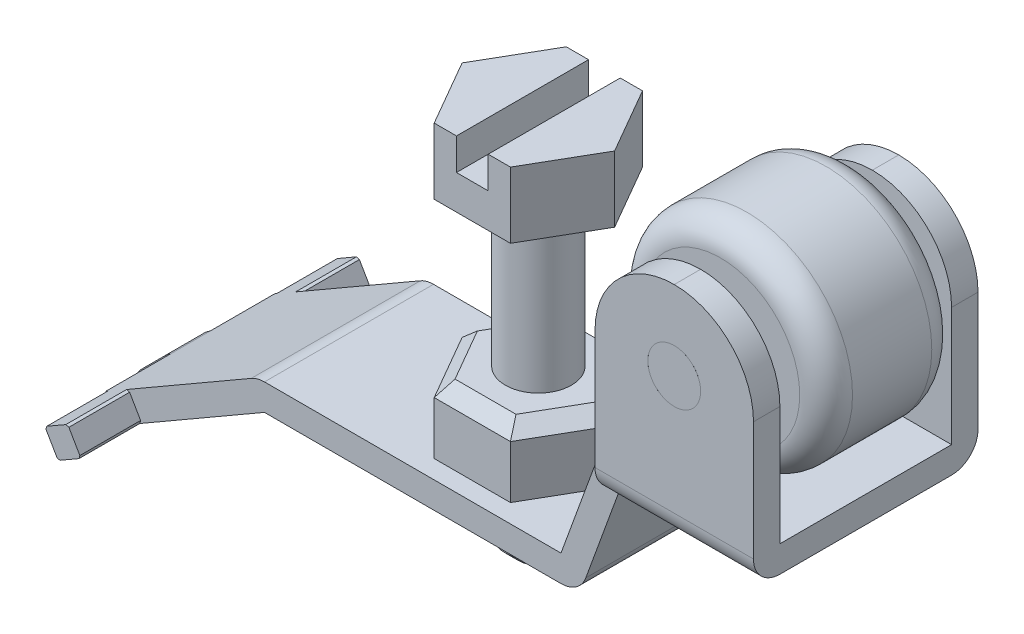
ISO-10303-21;
HEADER;
FILE_DESCRIPTION(('STEP AP214'),'2;1');
FILE_NAME('part.step','',(''),(''),'','','');
FILE_SCHEMA(('AUTOMOTIVE_DESIGN { 1 0 10303 214 1 1 1 1 }'));
ENDSEC;
DATA;
#1=APPLICATION_CONTEXT('core data for automotive mechanical design processes');
#2=APPLICATION_PROTOCOL_DEFINITION('international standard','automotive_design',2000,#1);
#3=PRODUCT_CONTEXT('',#1,'mechanical');
#4=PRODUCT('Part','Part','',(#3));
#5=PRODUCT_RELATED_PRODUCT_CATEGORY('part','',(#4));
#6=PRODUCT_DEFINITION_FORMATION('','',#4);
#7=PRODUCT_DEFINITION_CONTEXT('part definition',#1,'design');
#8=PRODUCT_DEFINITION('design','',#6,#7);
#9=PRODUCT_DEFINITION_SHAPE('','',#8);
#10=(LENGTH_UNIT() NAMED_UNIT(*) SI_UNIT(.MILLI.,.METRE.));
#11=(NAMED_UNIT(*) PLANE_ANGLE_UNIT() SI_UNIT($,.RADIAN.));
#12=(NAMED_UNIT(*) SI_UNIT($,.STERADIAN.) SOLID_ANGLE_UNIT());
#13=UNCERTAINTY_MEASURE_WITH_UNIT(LENGTH_MEASURE(1.E-05),#10,'distance_accuracy_value','');
#14=(GEOMETRIC_REPRESENTATION_CONTEXT(3) GLOBAL_UNCERTAINTY_ASSIGNED_CONTEXT((#13)) GLOBAL_UNIT_ASSIGNED_CONTEXT((#10,
#11,#12)) REPRESENTATION_CONTEXT('',''));
#15=CARTESIAN_POINT('',(0.,0.,0.));
#16=DIRECTION('',(0.,0.,1.));
#17=DIRECTION('',(1.,0.,0.));
#18=AXIS2_PLACEMENT_3D('',#15,#16,#17);
#19=CARTESIAN_POINT('',(21.8947785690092,12.5,2.5));
#20=DIRECTION('',(0.,0.,1.));
#21=DIRECTION('',(1.,0.,0.));
#22=AXIS2_PLACEMENT_3D('',#19,#20,#21);
#23=PLANE('',#22);
#24=CARTESIAN_POINT('',(21.8947785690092,12.5,2.5));
#25=DIRECTION('',(0.,0.,1.));
#26=DIRECTION('',(1.,0.,0.));
#27=AXIS2_PLACEMENT_3D('',#24,#25,#26);
#28=CIRCLE('',#27,3.);
#29=CARTESIAN_POINT('',(24.8947785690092,12.5,2.5));
#30=VERTEX_POINT('',#29);
#31=EDGE_CURVE('E57',#30,#30,#28,.T.);
#32=ORIENTED_EDGE('',*,*,#31,.T.);
#33=EDGE_LOOP('',(#32));
#34=FACE_BOUND('',#33,.T.);
#35=CARTESIAN_POINT('',(21.8947785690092,12.5,2.5));
#36=DIRECTION('',(0.,0.,1.));
#37=DIRECTION('',(1.,0.,0.));
#38=AXIS2_PLACEMENT_3D('',#35,#36,#37);
#39=CIRCLE('',#38,1.);
#40=CARTESIAN_POINT('',(22.8947785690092,12.5,2.5));
#41=VERTEX_POINT('',#40);
#42=EDGE_CURVE('E62',#41,#41,#39,.T.);
#43=ORIENTED_EDGE('',*,*,#42,.F.);
#44=EDGE_LOOP('',(#43));
#45=FACE_BOUND('',#44,.T.);
#46=ADVANCED_FACE('F42',(#34,#45),#23,.T.);
#47=CARTESIAN_POINT('',(21.8947785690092,12.5,-2.5));
#48=DIRECTION('',(0.,0.,1.));
#49=DIRECTION('',(1.,0.,0.));
#50=AXIS2_PLACEMENT_3D('',#47,#48,#49);
#51=PLANE('',#50);
#52=CARTESIAN_POINT('',(21.8947785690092,12.5,-2.5));
#53=DIRECTION('',(0.,0.,1.));
#54=DIRECTION('',(1.,0.,0.));
#55=AXIS2_PLACEMENT_3D('',#52,#53,#54);
#56=CIRCLE('',#55,3.);
#57=CARTESIAN_POINT('',(24.8947785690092,12.5,-2.5));
#58=VERTEX_POINT('',#57);
#59=EDGE_CURVE('E12',#58,#58,#56,.F.);
#60=ORIENTED_EDGE('',*,*,#59,.T.);
#61=EDGE_LOOP('',(#60));
#62=FACE_BOUND('',#61,.T.);
#63=CARTESIAN_POINT('',(21.8947785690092,12.5,-2.5));
#64=DIRECTION('',(0.,0.,1.));
#65=DIRECTION('',(1.,0.,0.));
#66=AXIS2_PLACEMENT_3D('',#63,#64,#65);
#67=CIRCLE('',#66,1.);
#68=CARTESIAN_POINT('',(22.8947785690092,12.5,-2.5));
#69=VERTEX_POINT('',#68);
#70=EDGE_CURVE('E63',#69,#69,#67,.T.);
#71=ORIENTED_EDGE('',*,*,#70,.T.);
#72=EDGE_LOOP('',(#71));
#73=FACE_BOUND('',#72,.T.);
#74=ADVANCED_FACE('F73',(#62,#73),#51,.F.);
#75=CARTESIAN_POINT('',(21.8947785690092,12.5,2.5));
#76=DIRECTION('',(0.,0.,-1.));
#77=DIRECTION('',(-1.,0.,0.));
#78=AXIS2_PLACEMENT_3D('',#75,#76,#77);
#79=CYLINDRICAL_SURFACE('',#78,4.);
#80=CARTESIAN_POINT('',(21.8947785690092,12.5,1.5));
#81=DIRECTION('',(0.,0.,1.));
#82=DIRECTION('',(1.,0.,0.));
#83=AXIS2_PLACEMENT_3D('',#80,#81,#82);
#84=CIRCLE('',#83,4.);
#85=CARTESIAN_POINT('',(25.8947785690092,12.5,1.5));
#86=VERTEX_POINT('',#85);
#87=EDGE_CURVE('E49',#86,#86,#84,.F.);
#88=ORIENTED_EDGE('',*,*,#87,.T.);
#89=EDGE_LOOP('',(#88));
#90=FACE_BOUND('',#89,.T.);
#91=CARTESIAN_POINT('',(21.8947785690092,12.5,-1.5));
#92=DIRECTION('',(0.,0.,1.));
#93=DIRECTION('',(1.,0.,0.));
#94=AXIS2_PLACEMENT_3D('',#91,#92,#93);
#95=CIRCLE('',#94,4.);
#96=CARTESIAN_POINT('',(25.8947785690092,12.5,-1.5));
#97=VERTEX_POINT('',#96);
#98=EDGE_CURVE('E53',#97,#97,#95,.T.);
#99=ORIENTED_EDGE('',*,*,#98,.T.);
#100=EDGE_LOOP('',(#99));
#101=FACE_BOUND('',#100,.T.);
#102=ADVANCED_FACE('F79',(#90,#101),#79,.T.);
#103=CARTESIAN_POINT('',(21.8947785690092,12.5,2.5));
#104=DIRECTION('',(0.,0.,-1.));
#105=DIRECTION('',(-1.,0.,0.));
#106=AXIS2_PLACEMENT_3D('',#103,#104,#105);
#107=CYLINDRICAL_SURFACE('',#106,1.);
#108=ORIENTED_EDGE('',*,*,#42,.T.);
#109=EDGE_LOOP('',(#108));
#110=FACE_BOUND('',#109,.T.);
#111=ORIENTED_EDGE('',*,*,#70,.F.);
#112=EDGE_LOOP('',(#111));
#113=FACE_BOUND('',#112,.T.);
#114=ADVANCED_FACE('F69',(#110,#113),#107,.F.);
#115=CARTESIAN_POINT('',(21.8947785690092,12.5,1.5));
#116=DIRECTION('',(0.,0.,1.));
#117=DIRECTION('',(1.,0.,0.));
#118=AXIS2_PLACEMENT_3D('',#115,#116,#117);
#119=TOROIDAL_SURFACE('',#118,3.,1.);
#120=ORIENTED_EDGE('',*,*,#87,.F.);
#121=EDGE_LOOP('',(#120));
#122=FACE_BOUND('',#121,.T.);
#123=ORIENTED_EDGE('',*,*,#31,.F.);
#124=EDGE_LOOP('',(#123));
#125=FACE_BOUND('',#124,.T.);
#126=ADVANCED_FACE('F84',(#122,#125),#119,.T.);
#127=CARTESIAN_POINT('',(21.8947785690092,12.5,-1.5));
#128=DIRECTION('',(0.,0.,1.));
#129=DIRECTION('',(1.,0.,0.));
#130=AXIS2_PLACEMENT_3D('',#127,#128,#129);
#131=TOROIDAL_SURFACE('',#130,3.,1.);
#132=ORIENTED_EDGE('',*,*,#59,.F.);
#133=EDGE_LOOP('',(#132));
#134=FACE_BOUND('',#133,.T.);
#135=ORIENTED_EDGE('',*,*,#98,.F.);
#136=EDGE_LOOP('',(#135));
#137=FACE_BOUND('',#136,.T.);
#138=ADVANCED_FACE('F44',(#134,#137),#131,.T.);
#139=CLOSED_SHELL('',(#46,#74,#102,#114,#126,#138));
#140=MANIFOLD_SOLID_BREP('B2',#139);
#141=CARTESIAN_POINT('',(21.8947785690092,12.5,7.0784271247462));
#142=DIRECTION('',(0.,0.,-1.));
#143=DIRECTION('',(-1.,0.,0.));
#144=AXIS2_PLACEMENT_3D('',#141,#142,#143);
#145=CYLINDRICAL_SURFACE('',#144,1.);
#146=CARTESIAN_POINT('',(21.8947785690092,12.5,4.25));
#147=DIRECTION('',(0.,0.,1.));
#148=DIRECTION('',(0.,-1.,0.));
#149=AXIS2_PLACEMENT_3D('',#146,#147,#148);
#150=CIRCLE('',#149,1.);
#151=CARTESIAN_POINT('',(21.8947785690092,11.5,4.25));
#152=VERTEX_POINT('',#151);
#153=EDGE_CURVE('E41',#152,#152,#150,.T.);
#154=ORIENTED_EDGE('',*,*,#153,.F.);
#155=EDGE_LOOP('',(#154));
#156=FACE_BOUND('',#155,.T.);
#157=CARTESIAN_POINT('',(21.8947785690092,12.5,-4.25));
#158=DIRECTION('',(0.,0.,-1.));
#159=DIRECTION('',(-1.,0.,0.));
#160=AXIS2_PLACEMENT_3D('',#157,#158,#159);
#161=CIRCLE('',#160,1.);
#162=CARTESIAN_POINT('',(20.8947785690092,12.5,-4.25));
#163=VERTEX_POINT('',#162);
#164=EDGE_CURVE('E151',#163,#163,#161,.F.);
#165=ORIENTED_EDGE('',*,*,#164,.T.);
#166=EDGE_LOOP('',(#165));
#167=FACE_BOUND('',#166,.T.);
#168=ADVANCED_FACE('F144',(#156,#167),#145,.T.);
#169=CARTESIAN_POINT('',(18.8947785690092,8.,4.25));
#170=DIRECTION('',(0.,0.,1.));
#171=DIRECTION('',(0.,-1.,0.));
#172=AXIS2_PLACEMENT_3D('',#169,#170,#171);
#173=PLANE('',#172);
#174=ORIENTED_EDGE('',*,*,#153,.T.);
#175=EDGE_LOOP('',(#174));
#176=FACE_BOUND('',#175,.T.);
#177=ADVANCED_FACE('F146',(#176),#173,.T.);
#178=CARTESIAN_POINT('',(18.8947785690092,8.,-4.25));
#179=DIRECTION('',(0.,0.,-1.));
#180=DIRECTION('',(-1.,0.,0.));
#181=AXIS2_PLACEMENT_3D('',#178,#179,#180);
#182=PLANE('',#181);
#183=ORIENTED_EDGE('',*,*,#164,.F.);
#184=EDGE_LOOP('',(#183));
#185=FACE_BOUND('',#184,.T.);
#186=ADVANCED_FACE('F158',(#185),#182,.T.);
#187=CLOSED_SHELL('',(#168,#177,#186));
#188=MANIFOLD_SOLID_BREP('B7',#187);
#189=CARTESIAN_POINT('',(13.9433756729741,14.5,-2.5));
#190=DIRECTION('',(0.,1.,0.));
#191=DIRECTION('',(0.,0.,1.));
#192=AXIS2_PLACEMENT_3D('',#189,#190,#191);
#193=PLANE('',#192);
#194=DIRECTION('',(0.,0.,1.));
#195=VECTOR('',#194,1.);
#196=CARTESIAN_POINT('',(11.9,14.5,-2.5));
#197=LINE('',#196,#195);
#198=CARTESIAN_POINT('',(11.9,14.5,-2.5));
#199=VERTEX_POINT('',#198);
#200=CARTESIAN_POINT('',(11.9,14.5,2.5));
#201=VERTEX_POINT('',#200);
#202=EDGE_CURVE('E203',#199,#201,#197,.T.);
#203=ORIENTED_EDGE('',*,*,#202,.F.);
#204=DIRECTION('',(-1.,0.,0.));
#205=VECTOR('',#204,1.);
#206=CARTESIAN_POINT('',(13.9433756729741,14.5,-2.5));
#207=LINE('',#206,#205);
#208=CARTESIAN_POINT('',(11.0566243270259,14.5,-2.5));
#209=VERTEX_POINT('',#208);
#210=EDGE_CURVE('E342',#199,#209,#207,.T.);
#211=ORIENTED_EDGE('',*,*,#210,.T.);
#212=DIRECTION('',(-0.5,0.,0.866025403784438));
#213=VECTOR('',#212,1.);
#214=CARTESIAN_POINT('',(11.0566243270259,14.5,-2.5));
#215=LINE('',#214,#213);
#216=CARTESIAN_POINT('',(9.61324865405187,14.5,0.));
#217=VERTEX_POINT('',#216);
#218=EDGE_CURVE('E274',#209,#217,#215,.T.);
#219=ORIENTED_EDGE('',*,*,#218,.T.);
#220=DIRECTION('',(0.5,0.,0.866025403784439));
#221=VECTOR('',#220,1.);
#222=CARTESIAN_POINT('',(9.61324865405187,14.5,0.));
#223=LINE('',#222,#221);
#224=CARTESIAN_POINT('',(11.0566243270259,14.5,2.5));
#225=VERTEX_POINT('',#224);
#226=EDGE_CURVE('E267',#217,#225,#223,.T.);
#227=ORIENTED_EDGE('',*,*,#226,.T.);
#228=DIRECTION('',(1.,0.,0.));
#229=VECTOR('',#228,1.);
#230=CARTESIAN_POINT('',(11.0566243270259,14.5,2.5));
#231=LINE('',#230,#229);
#232=EDGE_CURVE('E272',#225,#201,#231,.T.);
#233=ORIENTED_EDGE('',*,*,#232,.T.);
#234=EDGE_LOOP('',(#203,#211,#219,#227,#233));
#235=FACE_BOUND('',#234,.T.);
#236=ADVANCED_FACE('F195',(#235),#193,.T.);
#237=CARTESIAN_POINT('',(12.5,0.,0.));
#238=DIRECTION('',(0.,1.,0.));
#239=DIRECTION('',(0.,0.,1.));
#240=AXIS2_PLACEMENT_3D('',#237,#238,#239);
#241=CYLINDRICAL_SURFACE('',#240,1.25);
#242=CARTESIAN_POINT('',(12.5,0.5,0.));
#243=DIRECTION('',(0.,1.,0.));
#244=DIRECTION('',(0.,0.,1.));
#245=AXIS2_PLACEMENT_3D('',#242,#243,#244);
#246=CIRCLE('',#245,1.25);
#247=CARTESIAN_POINT('',(12.5,0.5,1.25));
#248=VERTEX_POINT('',#247);
#249=EDGE_CURVE('E323',#248,#248,#246,.T.);
#250=ORIENTED_EDGE('',*,*,#249,.T.);
#251=EDGE_LOOP('',(#250));
#252=FACE_BOUND('',#251,.T.);
#253=CARTESIAN_POINT('',(12.5,12.,0.));
#254=DIRECTION('',(0.,1.,0.));
#255=DIRECTION('',(0.,0.,1.));
#256=AXIS2_PLACEMENT_3D('',#253,#254,#255);
#257=CIRCLE('',#256,1.25);
#258=CARTESIAN_POINT('',(12.5,12.,1.25));
#259=VERTEX_POINT('',#258);
#260=EDGE_CURVE('E320',#259,#259,#257,.T.);
#261=ORIENTED_EDGE('',*,*,#260,.F.);
#262=EDGE_LOOP('',(#261));
#263=FACE_BOUND('',#262,.T.);
#264=ADVANCED_FACE('F387',(#252,#263),#241,.T.);
#265=CARTESIAN_POINT('',(12.5,0.,0.));
#266=DIRECTION('',(0.,1.,0.));
#267=DIRECTION('',(0.,0.,1.));
#268=AXIS2_PLACEMENT_3D('',#265,#266,#267);
#269=PLANE('',#268);
#270=CARTESIAN_POINT('',(12.5,0.,0.));
#271=DIRECTION('',(0.,1.,0.));
#272=DIRECTION('',(0.,0.,1.));
#273=AXIS2_PLACEMENT_3D('',#270,#271,#272);
#274=CIRCLE('',#273,0.749999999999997);
#275=CARTESIAN_POINT('',(12.5,0.,0.749999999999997));
#276=VERTEX_POINT('',#275);
#277=EDGE_CURVE('E326',#276,#276,#274,.F.);
#278=ORIENTED_EDGE('',*,*,#277,.T.);
#279=EDGE_LOOP('',(#278));
#280=FACE_BOUND('',#279,.T.);
#281=ADVANCED_FACE('F392',(#280),#269,.F.);
#282=CARTESIAN_POINT('',(12.5,0.5,0.));
#283=DIRECTION('',(0.,1.,0.));
#284=DIRECTION('',(0.,0.,1.));
#285=AXIS2_PLACEMENT_3D('',#282,#283,#284);
#286=CONICAL_SURFACE('',#285,1.25,0.785398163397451);
#287=ORIENTED_EDGE('',*,*,#277,.F.);
#288=EDGE_LOOP('',(#287));
#289=FACE_BOUND('',#288,.T.);
#290=ORIENTED_EDGE('',*,*,#249,.F.);
#291=EDGE_LOOP('',(#290));
#292=FACE_BOUND('',#291,.T.);
#293=ADVANCED_FACE('F197',(#289,#292),#286,.T.);
#294=CARTESIAN_POINT('',(15.3867513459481,14.5,0.));
#295=DIRECTION('',(-0.866025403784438,0.,0.5));
#296=DIRECTION('',(0.500000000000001,0.,0.866025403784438));
#297=AXIS2_PLACEMENT_3D('',#294,#295,#296);
#298=PLANE('',#297);
#299=DIRECTION('',(-0.5,0.,-0.866025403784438));
#300=VECTOR('',#299,1.);
#301=CARTESIAN_POINT('',(15.3867513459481,12.,0.));
#302=LINE('',#301,#300);
#303=CARTESIAN_POINT('',(15.3867513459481,12.,0.));
#304=VERTEX_POINT('',#303);
#305=CARTESIAN_POINT('',(13.9433756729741,12.,-2.5));
#306=VERTEX_POINT('',#305);
#307=EDGE_CURVE('E299',#304,#306,#302,.T.);
#308=ORIENTED_EDGE('',*,*,#307,.T.);
#309=DIRECTION('',(0.,-1.,0.));
#310=VECTOR('',#309,1.);
#311=CARTESIAN_POINT('',(13.9433756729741,14.5,-2.5));
#312=LINE('',#311,#310);
#313=CARTESIAN_POINT('',(13.9433756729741,14.5,-2.5));
#314=VERTEX_POINT('',#313);
#315=EDGE_CURVE('E318',#314,#306,#312,.T.);
#316=ORIENTED_EDGE('',*,*,#315,.F.);
#317=DIRECTION('',(-0.5,0.,-0.866025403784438));
#318=VECTOR('',#317,1.);
#319=CARTESIAN_POINT('',(15.3867513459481,14.5,0.));
#320=LINE('',#319,#318);
#321=CARTESIAN_POINT('',(15.3867513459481,14.5,0.));
#322=VERTEX_POINT('',#321);
#323=EDGE_CURVE('E311',#322,#314,#320,.T.);
#324=ORIENTED_EDGE('',*,*,#323,.F.);
#325=DIRECTION('',(0.,-1.,0.));
#326=VECTOR('',#325,1.);
#327=CARTESIAN_POINT('',(15.3867513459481,14.5,0.));
#328=LINE('',#327,#326);
#329=EDGE_CURVE('E295',#322,#304,#328,.T.);
#330=ORIENTED_EDGE('',*,*,#329,.T.);
#331=EDGE_LOOP('',(#308,#316,#324,#330));
#332=FACE_BOUND('',#331,.T.);
#333=ADVANCED_FACE('F413',(#332),#298,.F.);
#334=CARTESIAN_POINT('',(13.9433756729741,14.5,-2.5));
#335=DIRECTION('',(0.,0.,1.));
#336=DIRECTION('',(1.,0.,0.));
#337=AXIS2_PLACEMENT_3D('',#334,#335,#336);
#338=PLANE('',#337);
#339=ORIENTED_EDGE('',*,*,#210,.F.);
#340=DIRECTION('',(0.,-1.,0.));
#341=VECTOR('',#340,1.);
#342=CARTESIAN_POINT('',(11.9,14.5,-2.5));
#343=LINE('',#342,#341);
#344=CARTESIAN_POINT('',(11.9,13.3,-2.5));
#345=VERTEX_POINT('',#344);
#346=EDGE_CURVE('E338',#199,#345,#343,.T.);
#347=ORIENTED_EDGE('',*,*,#346,.T.);
#348=DIRECTION('',(1.,0.,0.));
#349=VECTOR('',#348,1.);
#350=CARTESIAN_POINT('',(13.9433756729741,13.3,-2.5));
#351=LINE('',#350,#349);
#352=CARTESIAN_POINT('',(13.1,13.3,-2.5));
#353=VERTEX_POINT('',#352);
#354=EDGE_CURVE('E303',#345,#353,#351,.T.);
#355=ORIENTED_EDGE('',*,*,#354,.T.);
#356=DIRECTION('',(0.,1.,0.));
#357=VECTOR('',#356,1.);
#358=CARTESIAN_POINT('',(13.1,14.5,-2.5));
#359=LINE('',#358,#357);
#360=CARTESIAN_POINT('',(13.1,14.5,-2.5));
#361=VERTEX_POINT('',#360);
#362=EDGE_CURVE('E354',#353,#361,#359,.T.);
#363=ORIENTED_EDGE('',*,*,#362,.T.);
#364=EDGE_CURVE('E255',#314,#361,#207,.T.);
#365=ORIENTED_EDGE('',*,*,#364,.F.);
#366=ORIENTED_EDGE('',*,*,#315,.T.);
#367=DIRECTION('',(-1.,0.,0.));
#368=VECTOR('',#367,1.);
#369=CARTESIAN_POINT('',(13.9433756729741,12.,-2.5));
#370=LINE('',#369,#368);
#371=CARTESIAN_POINT('',(11.0566243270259,12.,-2.5));
#372=VERTEX_POINT('',#371);
#373=EDGE_CURVE('E302',#306,#372,#370,.T.);
#374=ORIENTED_EDGE('',*,*,#373,.T.);
#375=DIRECTION('',(0.,-1.,0.));
#376=VECTOR('',#375,1.);
#377=CARTESIAN_POINT('',(11.0566243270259,14.5,-2.5));
#378=LINE('',#377,#376);
#379=EDGE_CURVE('E315',#209,#372,#378,.T.);
#380=ORIENTED_EDGE('',*,*,#379,.F.);
#381=EDGE_LOOP('',(#339,#347,#355,#363,#365,#366,#374,#380));
#382=FACE_BOUND('',#381,.T.);
#383=ADVANCED_FACE('F346',(#382),#338,.F.);
#384=CARTESIAN_POINT('',(11.0566243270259,14.5,-2.5));
#385=DIRECTION('',(0.866025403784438,0.,0.5));
#386=DIRECTION('',(0.5,0.,-0.866025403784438));
#387=AXIS2_PLACEMENT_3D('',#384,#385,#386);
#388=PLANE('',#387);
#389=DIRECTION('',(-0.5,0.,0.866025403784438));
#390=VECTOR('',#389,1.);
#391=CARTESIAN_POINT('',(11.0566243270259,12.,-2.5));
#392=LINE('',#391,#390);
#393=CARTESIAN_POINT('',(9.61324865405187,12.,0.));
#394=VERTEX_POINT('',#393);
#395=EDGE_CURVE('E305',#372,#394,#392,.T.);
#396=ORIENTED_EDGE('',*,*,#395,.T.);
#397=DIRECTION('',(0.,-1.,0.));
#398=VECTOR('',#397,1.);
#399=CARTESIAN_POINT('',(9.61324865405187,14.5,0.));
#400=LINE('',#399,#398);
#401=EDGE_CURVE('E287',#217,#394,#400,.T.);
#402=ORIENTED_EDGE('',*,*,#401,.F.);
#403=ORIENTED_EDGE('',*,*,#218,.F.);
#404=ORIENTED_EDGE('',*,*,#379,.T.);
#405=EDGE_LOOP('',(#396,#402,#403,#404));
#406=FACE_BOUND('',#405,.T.);
#407=ADVANCED_FACE('F407',(#406),#388,.F.);
#408=CARTESIAN_POINT('',(9.61324865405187,14.5,0.));
#409=DIRECTION('',(0.866025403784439,0.,-0.5));
#410=DIRECTION('',(-0.5,0.,-0.866025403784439));
#411=AXIS2_PLACEMENT_3D('',#408,#409,#410);
#412=PLANE('',#411);
#413=DIRECTION('',(0.5,0.,0.866025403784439));
#414=VECTOR('',#413,1.);
#415=CARTESIAN_POINT('',(9.61324865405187,12.,0.));
#416=LINE('',#415,#414);
#417=CARTESIAN_POINT('',(11.0566243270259,12.,2.5));
#418=VERTEX_POINT('',#417);
#419=EDGE_CURVE('E284',#394,#418,#416,.T.);
#420=ORIENTED_EDGE('',*,*,#419,.T.);
#421=DIRECTION('',(0.,-1.,0.));
#422=VECTOR('',#421,1.);
#423=CARTESIAN_POINT('',(11.0566243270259,14.5,2.5));
#424=LINE('',#423,#422);
#425=EDGE_CURVE('E281',#225,#418,#424,.T.);
#426=ORIENTED_EDGE('',*,*,#425,.F.);
#427=ORIENTED_EDGE('',*,*,#226,.F.);
#428=ORIENTED_EDGE('',*,*,#401,.T.);
#429=EDGE_LOOP('',(#420,#426,#427,#428));
#430=FACE_BOUND('',#429,.T.);
#431=ADVANCED_FACE('F282',(#430),#412,.F.);
#432=CARTESIAN_POINT('',(11.0566243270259,14.5,2.5));
#433=DIRECTION('',(0.,0.,-1.));
#434=DIRECTION('',(-1.,0.,0.));
#435=AXIS2_PLACEMENT_3D('',#432,#433,#434);
#436=PLANE('',#435);
#437=DIRECTION('',(-1.,0.,0.));
#438=VECTOR('',#437,1.);
#439=CARTESIAN_POINT('',(11.0566243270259,13.3,2.5));
#440=LINE('',#439,#438);
#441=CARTESIAN_POINT('',(13.1,13.3,2.5));
#442=VERTEX_POINT('',#441);
#443=CARTESIAN_POINT('',(11.9,13.3,2.5));
#444=VERTEX_POINT('',#443);
#445=EDGE_CURVE('E142',#442,#444,#440,.T.);
#446=ORIENTED_EDGE('',*,*,#445,.T.);
#447=DIRECTION('',(0.,1.,0.));
#448=VECTOR('',#447,1.);
#449=CARTESIAN_POINT('',(11.9,14.5,2.5));
#450=LINE('',#449,#448);
#451=EDGE_CURVE('E293',#444,#201,#450,.T.);
#452=ORIENTED_EDGE('',*,*,#451,.T.);
#453=ORIENTED_EDGE('',*,*,#232,.F.);
#454=ORIENTED_EDGE('',*,*,#425,.T.);
#455=DIRECTION('',(1.,0.,0.));
#456=VECTOR('',#455,1.);
#457=CARTESIAN_POINT('',(11.0566243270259,12.,2.5));
#458=LINE('',#457,#456);
#459=CARTESIAN_POINT('',(13.9433756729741,12.,2.5));
#460=VERTEX_POINT('',#459);
#461=EDGE_CURVE('E308',#418,#460,#458,.T.);
#462=ORIENTED_EDGE('',*,*,#461,.T.);
#463=DIRECTION('',(0.,-1.,0.));
#464=VECTOR('',#463,1.);
#465=CARTESIAN_POINT('',(13.9433756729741,14.5,2.5));
#466=LINE('',#465,#464);
#467=CARTESIAN_POINT('',(13.9433756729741,14.5,2.5));
#468=VERTEX_POINT('',#467);
#469=EDGE_CURVE('E288',#468,#460,#466,.T.);
#470=ORIENTED_EDGE('',*,*,#469,.F.);
#471=CARTESIAN_POINT('',(13.1,14.5,2.5));
#472=VERTEX_POINT('',#471);
#473=EDGE_CURVE('E278',#472,#468,#231,.T.);
#474=ORIENTED_EDGE('',*,*,#473,.F.);
#475=DIRECTION('',(0.,-1.,0.));
#476=VECTOR('',#475,1.);
#477=CARTESIAN_POINT('',(13.1,14.5,2.5));
#478=LINE('',#477,#476);
#479=EDGE_CURVE('E210',#472,#442,#478,.T.);
#480=ORIENTED_EDGE('',*,*,#479,.T.);
#481=EDGE_LOOP('',(#446,#452,#453,#454,#462,#470,#474,#480));
#482=FACE_BOUND('',#481,.T.);
#483=ADVANCED_FACE('F291',(#482),#436,.F.);
#484=CARTESIAN_POINT('',(13.9433756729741,14.5,2.5));
#485=DIRECTION('',(-0.866025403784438,0.,-0.5));
#486=DIRECTION('',(-0.5,0.,0.866025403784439));
#487=AXIS2_PLACEMENT_3D('',#484,#485,#486);
#488=PLANE('',#487);
#489=DIRECTION('',(0.5,0.,-0.866025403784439));
#490=VECTOR('',#489,1.);
#491=CARTESIAN_POINT('',(13.9433756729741,12.,2.5));
#492=LINE('',#491,#490);
#493=EDGE_CURVE('E246',#460,#304,#492,.T.);
#494=ORIENTED_EDGE('',*,*,#493,.T.);
#495=ORIENTED_EDGE('',*,*,#329,.F.);
#496=DIRECTION('',(0.5,0.,-0.866025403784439));
#497=VECTOR('',#496,1.);
#498=CARTESIAN_POINT('',(13.9433756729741,14.5,2.5));
#499=LINE('',#498,#497);
#500=EDGE_CURVE('E219',#468,#322,#499,.T.);
#501=ORIENTED_EDGE('',*,*,#500,.F.);
#502=ORIENTED_EDGE('',*,*,#469,.T.);
#503=EDGE_LOOP('',(#494,#495,#501,#502));
#504=FACE_BOUND('',#503,.T.);
#505=ADVANCED_FACE('F395',(#504),#488,.F.);
#506=DIRECTION('',(0.,0.,-1.));
#507=VECTOR('',#506,1.);
#508=CARTESIAN_POINT('',(13.1,14.5,-2.5));
#509=LINE('',#508,#507);
#510=EDGE_CURVE('E329',#472,#361,#509,.T.);
#511=ORIENTED_EDGE('',*,*,#510,.F.);
#512=ORIENTED_EDGE('',*,*,#473,.T.);
#513=ORIENTED_EDGE('',*,*,#500,.T.);
#514=ORIENTED_EDGE('',*,*,#323,.T.);
#515=ORIENTED_EDGE('',*,*,#364,.T.);
#516=EDGE_LOOP('',(#511,#512,#513,#514,#515));
#517=FACE_BOUND('',#516,.T.);
#518=ADVANCED_FACE('F371',(#517),#193,.T.);
#519=CARTESIAN_POINT('',(13.9433756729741,12.,-2.5));
#520=DIRECTION('',(0.,1.,0.));
#521=DIRECTION('',(0.,0.,1.));
#522=AXIS2_PLACEMENT_3D('',#519,#520,#521);
#523=PLANE('',#522);
#524=ORIENTED_EDGE('',*,*,#260,.T.);
#525=EDGE_LOOP('',(#524));
#526=FACE_BOUND('',#525,.T.);
#527=ORIENTED_EDGE('',*,*,#307,.F.);
#528=ORIENTED_EDGE('',*,*,#493,.F.);
#529=ORIENTED_EDGE('',*,*,#461,.F.);
#530=ORIENTED_EDGE('',*,*,#419,.F.);
#531=ORIENTED_EDGE('',*,*,#395,.F.);
#532=ORIENTED_EDGE('',*,*,#373,.F.);
#533=EDGE_LOOP('',(#527,#528,#529,#530,#531,#532));
#534=FACE_BOUND('',#533,.T.);
#535=ADVANCED_FACE('F376',(#526,#534),#523,.F.);
#536=CARTESIAN_POINT('',(11.9,13.3,-5.));
#537=DIRECTION('',(0.,-1.,0.));
#538=DIRECTION('',(0.,0.,-1.));
#539=AXIS2_PLACEMENT_3D('',#536,#537,#538);
#540=PLANE('',#539);
#541=DIRECTION('',(0.,0.,1.));
#542=VECTOR('',#541,1.);
#543=CARTESIAN_POINT('',(11.9,13.3,-5.));
#544=LINE('',#543,#542);
#545=EDGE_CURVE('E358',#345,#444,#544,.T.);
#546=ORIENTED_EDGE('',*,*,#545,.T.);
#547=ORIENTED_EDGE('',*,*,#445,.F.);
#548=DIRECTION('',(0.,0.,1.));
#549=VECTOR('',#548,1.);
#550=CARTESIAN_POINT('',(13.1,13.3,-5.));
#551=LINE('',#550,#549);
#552=EDGE_CURVE('E357',#353,#442,#551,.T.);
#553=ORIENTED_EDGE('',*,*,#552,.F.);
#554=ORIENTED_EDGE('',*,*,#354,.F.);
#555=EDGE_LOOP('',(#546,#547,#553,#554));
#556=FACE_BOUND('',#555,.T.);
#557=ADVANCED_FACE('F374',(#556),#540,.F.);
#558=CARTESIAN_POINT('',(11.9,14.5,-5.));
#559=DIRECTION('',(-1.,0.,0.));
#560=DIRECTION('',(0.,0.,1.));
#561=AXIS2_PLACEMENT_3D('',#558,#559,#560);
#562=PLANE('',#561);
#563=ORIENTED_EDGE('',*,*,#202,.T.);
#564=ORIENTED_EDGE('',*,*,#451,.F.);
#565=ORIENTED_EDGE('',*,*,#545,.F.);
#566=ORIENTED_EDGE('',*,*,#346,.F.);
#567=EDGE_LOOP('',(#563,#564,#565,#566));
#568=FACE_BOUND('',#567,.T.);
#569=ADVANCED_FACE('F333',(#568),#562,.F.);
#570=CARTESIAN_POINT('',(13.1,13.3,-5.));
#571=DIRECTION('',(1.,0.,0.));
#572=DIRECTION('',(0.,0.,-1.));
#573=AXIS2_PLACEMENT_3D('',#570,#571,#572);
#574=PLANE('',#573);
#575=ORIENTED_EDGE('',*,*,#552,.T.);
#576=ORIENTED_EDGE('',*,*,#479,.F.);
#577=ORIENTED_EDGE('',*,*,#510,.T.);
#578=ORIENTED_EDGE('',*,*,#362,.F.);
#579=EDGE_LOOP('',(#575,#576,#577,#578));
#580=FACE_BOUND('',#579,.T.);
#581=ADVANCED_FACE('F363',(#580),#574,.F.);
#582=CLOSED_SHELL('',(#236,#264,#281,#293,#333,#383,#407,#431,#483,#505,#518,#535,#557,#569,#581));
#583=MANIFOLD_SOLID_BREP('B36',#582);
#584=CARTESIAN_POINT('',(15.3867513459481,6.,0.));
#585=DIRECTION('',(0.,1.,0.));
#586=DIRECTION('',(0.,0.,1.));
#587=AXIS2_PLACEMENT_3D('',#584,#585,#586);
#588=PLANE('',#587);
#589=DIRECTION('',(-1.,0.,0.));
#590=VECTOR('',#589,1.);
#591=CARTESIAN_POINT('',(11.0566243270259,6.,-2.));
#592=LINE('',#591,#590);
#593=CARTESIAN_POINT('',(13.6547005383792,6.,-2.));
#594=VERTEX_POINT('',#593);
#595=CARTESIAN_POINT('',(11.3452994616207,6.,-2.));
#596=VERTEX_POINT('',#595);
#597=EDGE_CURVE('E653',#594,#596,#592,.T.);
#598=ORIENTED_EDGE('',*,*,#597,.T.);
#599=DIRECTION('',(-0.5,0.,0.866025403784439));
#600=VECTOR('',#599,1.);
#601=CARTESIAN_POINT('',(10.0462613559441,6.,0.25));
#602=LINE('',#601,#600);
#603=CARTESIAN_POINT('',(10.1905989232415,6.,0.));
#604=VERTEX_POINT('',#603);
#605=EDGE_CURVE('E655',#596,#604,#602,.T.);
#606=ORIENTED_EDGE('',*,*,#605,.T.);
#607=DIRECTION('',(0.5,0.,0.866025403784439));
#608=VECTOR('',#607,1.);
#609=CARTESIAN_POINT('',(11.4896370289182,6.,2.25));
#610=LINE('',#609,#608);
#611=CARTESIAN_POINT('',(11.3452994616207,6.,2.));
#612=VERTEX_POINT('',#611);
#613=EDGE_CURVE('E606',#604,#612,#610,.T.);
#614=ORIENTED_EDGE('',*,*,#613,.T.);
#615=DIRECTION('',(1.,0.,0.));
#616=VECTOR('',#615,1.);
#617=CARTESIAN_POINT('',(13.9433756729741,6.,2.));
#618=LINE('',#617,#616);
#619=CARTESIAN_POINT('',(13.6547005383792,6.,2.));
#620=VERTEX_POINT('',#619);
#621=EDGE_CURVE('E647',#612,#620,#618,.T.);
#622=ORIENTED_EDGE('',*,*,#621,.T.);
#623=DIRECTION('',(0.5,0.,-0.866025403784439));
#624=VECTOR('',#623,1.);
#625=CARTESIAN_POINT('',(14.9537386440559,6.,-0.250000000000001));
#626=LINE('',#625,#624);
#627=CARTESIAN_POINT('',(14.8094010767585,6.,0.));
#628=VERTEX_POINT('',#627);
#629=EDGE_CURVE('E649',#620,#628,#626,.T.);
#630=ORIENTED_EDGE('',*,*,#629,.T.);
#631=DIRECTION('',(-0.5,0.,-0.866025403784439));
#632=VECTOR('',#631,1.);
#633=CARTESIAN_POINT('',(13.5103629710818,6.,-2.25));
#634=LINE('',#633,#632);
#635=EDGE_CURVE('E651',#628,#594,#634,.T.);
#636=ORIENTED_EDGE('',*,*,#635,.T.);
#637=EDGE_LOOP('',(#598,#606,#614,#622,#630,#636));
#638=FACE_BOUND('',#637,.T.);
#639=CARTESIAN_POINT('',(12.5,6.,0.));
#640=DIRECTION('',(0.,1.,0.));
#641=DIRECTION('',(0.,0.,1.));
#642=AXIS2_PLACEMENT_3D('',#639,#640,#641);
#643=CIRCLE('',#642,1.);
#644=CARTESIAN_POINT('',(12.5,6.,1.));
#645=VERTEX_POINT('',#644);
#646=EDGE_CURVE('E622',#645,#645,#643,.T.);
#647=ORIENTED_EDGE('',*,*,#646,.F.);
#648=EDGE_LOOP('',(#647));
#649=FACE_BOUND('',#648,.T.);
#650=ADVANCED_FACE('F526',(#638,#649),#588,.T.);
#651=CARTESIAN_POINT('',(15.3867513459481,3.5,0.));
#652=DIRECTION('',(0.,1.,0.));
#653=DIRECTION('',(0.,0.,1.));
#654=AXIS2_PLACEMENT_3D('',#651,#652,#653);
#655=PLANE('',#654);
#656=DIRECTION('',(0.5,0.,-0.866025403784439));
#657=VECTOR('',#656,1.);
#658=CARTESIAN_POINT('',(13.9433756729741,3.5,2.5));
#659=LINE('',#658,#657);
#660=CARTESIAN_POINT('',(13.9433756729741,3.5,2.5));
#661=VERTEX_POINT('',#660);
#662=CARTESIAN_POINT('',(15.3867513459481,3.5,0.));
#663=VERTEX_POINT('',#662);
#664=EDGE_CURVE('E614',#661,#663,#659,.T.);
#665=ORIENTED_EDGE('',*,*,#664,.F.);
#666=DIRECTION('',(1.,0.,0.));
#667=VECTOR('',#666,1.);
#668=CARTESIAN_POINT('',(11.0566243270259,3.5,2.5));
#669=LINE('',#668,#667);
#670=CARTESIAN_POINT('',(11.0566243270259,3.5,2.5));
#671=VERTEX_POINT('',#670);
#672=EDGE_CURVE('E636',#671,#661,#669,.T.);
#673=ORIENTED_EDGE('',*,*,#672,.F.);
#674=DIRECTION('',(0.5,0.,0.866025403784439));
#675=VECTOR('',#674,1.);
#676=CARTESIAN_POINT('',(9.61324865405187,3.5,0.));
#677=LINE('',#676,#675);
#678=CARTESIAN_POINT('',(9.61324865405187,3.5,0.));
#679=VERTEX_POINT('',#678);
#680=EDGE_CURVE('E633',#679,#671,#677,.T.);
#681=ORIENTED_EDGE('',*,*,#680,.F.);
#682=DIRECTION('',(-0.5,0.,0.866025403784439));
#683=VECTOR('',#682,1.);
#684=CARTESIAN_POINT('',(11.0566243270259,3.5,-2.5));
#685=LINE('',#684,#683);
#686=CARTESIAN_POINT('',(11.0566243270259,3.5,-2.5));
#687=VERTEX_POINT('',#686);
#688=EDGE_CURVE('E630',#687,#679,#685,.T.);
#689=ORIENTED_EDGE('',*,*,#688,.F.);
#690=DIRECTION('',(-1.,0.,0.));
#691=VECTOR('',#690,1.);
#692=CARTESIAN_POINT('',(13.9433756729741,3.5,-2.5));
#693=LINE('',#692,#691);
#694=CARTESIAN_POINT('',(13.9433756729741,3.5,-2.5));
#695=VERTEX_POINT('',#694);
#696=EDGE_CURVE('E617',#695,#687,#693,.T.);
#697=ORIENTED_EDGE('',*,*,#696,.F.);
#698=DIRECTION('',(-0.5,0.,-0.866025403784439));
#699=VECTOR('',#698,1.);
#700=CARTESIAN_POINT('',(15.3867513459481,3.5,0.));
#701=LINE('',#700,#699);
#702=EDGE_CURVE('E601',#663,#695,#701,.T.);
#703=ORIENTED_EDGE('',*,*,#702,.F.);
#704=EDGE_LOOP('',(#665,#673,#681,#689,#697,#703));
#705=FACE_BOUND('',#704,.T.);
#706=CARTESIAN_POINT('',(12.5,3.5,0.));
#707=DIRECTION('',(0.,1.,0.));
#708=DIRECTION('',(0.,0.,1.));
#709=AXIS2_PLACEMENT_3D('',#706,#707,#708);
#710=CIRCLE('',#709,1.);
#711=CARTESIAN_POINT('',(12.5,3.5,1.));
#712=VERTEX_POINT('',#711);
#713=EDGE_CURVE('E625',#712,#712,#710,.T.);
#714=ORIENTED_EDGE('',*,*,#713,.T.);
#715=EDGE_LOOP('',(#714));
#716=FACE_BOUND('',#715,.T.);
#717=ADVANCED_FACE('F611',(#705,#716),#655,.F.);
#718=CARTESIAN_POINT('',(13.9433756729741,6.,2.5));
#719=DIRECTION('',(-0.866025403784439,0.,-0.5));
#720=DIRECTION('',(-0.5,0.,0.866025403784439));
#721=AXIS2_PLACEMENT_3D('',#718,#719,#720);
#722=PLANE('',#721);
#723=DIRECTION('',(0.,-1.,0.));
#724=VECTOR('',#723,1.);
#725=CARTESIAN_POINT('',(15.3867513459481,6.,0.));
#726=LINE('',#725,#724);
#727=CARTESIAN_POINT('',(15.3867513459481,5.5,0.));
#728=VERTEX_POINT('',#727);
#729=EDGE_CURVE('E597',#728,#663,#726,.T.);
#730=ORIENTED_EDGE('',*,*,#729,.F.);
#731=DIRECTION('',(-0.5,0.,0.866025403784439));
#732=VECTOR('',#731,1.);
#733=CARTESIAN_POINT('',(13.9433756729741,5.5,2.5));
#734=LINE('',#733,#732);
#735=CARTESIAN_POINT('',(13.9433756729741,5.5,2.5));
#736=VERTEX_POINT('',#735);
#737=EDGE_CURVE('E550',#728,#736,#734,.T.);
#738=ORIENTED_EDGE('',*,*,#737,.T.);
#739=DIRECTION('',(0.,-1.,0.));
#740=VECTOR('',#739,1.);
#741=CARTESIAN_POINT('',(13.9433756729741,6.,2.5));
#742=LINE('',#741,#740);
#743=EDGE_CURVE('E620',#736,#661,#742,.T.);
#744=ORIENTED_EDGE('',*,*,#743,.T.);
#745=ORIENTED_EDGE('',*,*,#664,.T.);
#746=EDGE_LOOP('',(#730,#738,#744,#745));
#747=FACE_BOUND('',#746,.T.);
#748=ADVANCED_FACE('F619',(#747),#722,.F.);
#749=CARTESIAN_POINT('',(15.3867513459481,6.,0.));
#750=DIRECTION('',(-0.866025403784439,0.,0.5));
#751=DIRECTION('',(0.5,0.,0.866025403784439));
#752=AXIS2_PLACEMENT_3D('',#749,#750,#751);
#753=PLANE('',#752);
#754=DIRECTION('',(0.,-1.,0.));
#755=VECTOR('',#754,1.);
#756=CARTESIAN_POINT('',(13.9433756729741,6.,-2.5));
#757=LINE('',#756,#755);
#758=CARTESIAN_POINT('',(13.9433756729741,5.5,-2.5));
#759=VERTEX_POINT('',#758);
#760=EDGE_CURVE('E607',#759,#695,#757,.T.);
#761=ORIENTED_EDGE('',*,*,#760,.F.);
#762=DIRECTION('',(0.5,0.,0.866025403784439));
#763=VECTOR('',#762,1.);
#764=CARTESIAN_POINT('',(15.3867513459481,5.5,0.));
#765=LINE('',#764,#763);
#766=EDGE_CURVE('E604',#759,#728,#765,.T.);
#767=ORIENTED_EDGE('',*,*,#766,.T.);
#768=ORIENTED_EDGE('',*,*,#729,.T.);
#769=ORIENTED_EDGE('',*,*,#702,.T.);
#770=EDGE_LOOP('',(#761,#767,#768,#769));
#771=FACE_BOUND('',#770,.T.);
#772=ADVANCED_FACE('F600',(#771),#753,.F.);
#773=CARTESIAN_POINT('',(13.9433756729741,6.,-2.5));
#774=DIRECTION('',(0.,0.,1.));
#775=DIRECTION('',(1.,0.,0.));
#776=AXIS2_PLACEMENT_3D('',#773,#774,#775);
#777=PLANE('',#776);
#778=DIRECTION('',(0.,-1.,0.));
#779=VECTOR('',#778,1.);
#780=CARTESIAN_POINT('',(11.0566243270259,6.,-2.5));
#781=LINE('',#780,#779);
#782=CARTESIAN_POINT('',(11.0566243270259,5.5,-2.5));
#783=VERTEX_POINT('',#782);
#784=EDGE_CURVE('E643',#783,#687,#781,.T.);
#785=ORIENTED_EDGE('',*,*,#784,.F.);
#786=DIRECTION('',(1.,0.,0.));
#787=VECTOR('',#786,1.);
#788=CARTESIAN_POINT('',(13.9433756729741,5.5,-2.5));
#789=LINE('',#788,#787);
#790=EDGE_CURVE('E661',#783,#759,#789,.T.);
#791=ORIENTED_EDGE('',*,*,#790,.T.);
#792=ORIENTED_EDGE('',*,*,#760,.T.);
#793=ORIENTED_EDGE('',*,*,#696,.T.);
#794=EDGE_LOOP('',(#785,#791,#792,#793));
#795=FACE_BOUND('',#794,.T.);
#796=ADVANCED_FACE('F715',(#795),#777,.F.);
#797=CARTESIAN_POINT('',(11.0566243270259,6.,-2.5));
#798=DIRECTION('',(0.866025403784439,0.,0.5));
#799=DIRECTION('',(0.5,0.,-0.866025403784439));
#800=AXIS2_PLACEMENT_3D('',#797,#798,#799);
#801=PLANE('',#800);
#802=DIRECTION('',(0.,-1.,0.));
#803=VECTOR('',#802,1.);
#804=CARTESIAN_POINT('',(9.61324865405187,6.,0.));
#805=LINE('',#804,#803);
#806=CARTESIAN_POINT('',(9.61324865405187,5.5,0.));
#807=VERTEX_POINT('',#806);
#808=EDGE_CURVE('E641',#807,#679,#805,.T.);
#809=ORIENTED_EDGE('',*,*,#808,.F.);
#810=DIRECTION('',(0.5,0.,-0.866025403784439));
#811=VECTOR('',#810,1.);
#812=CARTESIAN_POINT('',(11.0566243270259,5.5,-2.5));
#813=LINE('',#812,#811);
#814=EDGE_CURVE('E658',#807,#783,#813,.T.);
#815=ORIENTED_EDGE('',*,*,#814,.T.);
#816=ORIENTED_EDGE('',*,*,#784,.T.);
#817=ORIENTED_EDGE('',*,*,#688,.T.);
#818=EDGE_LOOP('',(#809,#815,#816,#817));
#819=FACE_BOUND('',#818,.T.);
#820=ADVANCED_FACE('F711',(#819),#801,.F.);
#821=CARTESIAN_POINT('',(9.61324865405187,6.,0.));
#822=DIRECTION('',(0.866025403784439,0.,-0.5));
#823=DIRECTION('',(-0.5,0.,-0.866025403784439));
#824=AXIS2_PLACEMENT_3D('',#821,#822,#823);
#825=PLANE('',#824);
#826=DIRECTION('',(0.,-1.,0.));
#827=VECTOR('',#826,1.);
#828=CARTESIAN_POINT('',(11.0566243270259,6.,2.5));
#829=LINE('',#828,#827);
#830=CARTESIAN_POINT('',(11.0566243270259,5.5,2.5));
#831=VERTEX_POINT('',#830);
#832=EDGE_CURVE('E639',#831,#671,#829,.T.);
#833=ORIENTED_EDGE('',*,*,#832,.F.);
#834=DIRECTION('',(-0.5,0.,-0.866025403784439));
#835=VECTOR('',#834,1.);
#836=CARTESIAN_POINT('',(9.61324865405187,5.5,0.));
#837=LINE('',#836,#835);
#838=EDGE_CURVE('E193',#831,#807,#837,.T.);
#839=ORIENTED_EDGE('',*,*,#838,.T.);
#840=ORIENTED_EDGE('',*,*,#808,.T.);
#841=ORIENTED_EDGE('',*,*,#680,.T.);
#842=EDGE_LOOP('',(#833,#839,#840,#841));
#843=FACE_BOUND('',#842,.T.);
#844=ADVANCED_FACE('F698',(#843),#825,.F.);
#845=CARTESIAN_POINT('',(11.0566243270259,6.,2.5));
#846=DIRECTION('',(0.,0.,-1.));
#847=DIRECTION('',(-1.,0.,0.));
#848=AXIS2_PLACEMENT_3D('',#845,#846,#847);
#849=PLANE('',#848);
#850=ORIENTED_EDGE('',*,*,#743,.F.);
#851=DIRECTION('',(-1.,0.,0.));
#852=VECTOR('',#851,1.);
#853=CARTESIAN_POINT('',(11.0566243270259,5.5,2.5));
#854=LINE('',#853,#852);
#855=EDGE_CURVE('E535',#736,#831,#854,.T.);
#856=ORIENTED_EDGE('',*,*,#855,.T.);
#857=ORIENTED_EDGE('',*,*,#832,.T.);
#858=ORIENTED_EDGE('',*,*,#672,.T.);
#859=EDGE_LOOP('',(#850,#856,#857,#858));
#860=FACE_BOUND('',#859,.T.);
#861=ADVANCED_FACE('F689',(#860),#849,.F.);
#862=CARTESIAN_POINT('',(12.5,6.,0.));
#863=DIRECTION('',(0.,-1.,0.));
#864=DIRECTION('',(0.,0.,-1.));
#865=AXIS2_PLACEMENT_3D('',#862,#863,#864);
#866=CYLINDRICAL_SURFACE('',#865,1.);
#867=ORIENTED_EDGE('',*,*,#646,.T.);
#868=EDGE_LOOP('',(#867));
#869=FACE_BOUND('',#868,.T.);
#870=ORIENTED_EDGE('',*,*,#713,.F.);
#871=EDGE_LOOP('',(#870));
#872=FACE_BOUND('',#871,.T.);
#873=ADVANCED_FACE('F687',(#869,#872),#866,.F.);
#874=CARTESIAN_POINT('',(14.9537386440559,6.,-0.25));
#875=DIRECTION('',(0.612372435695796,0.707106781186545,0.353553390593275));
#876=DIRECTION('',(-0.755928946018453,0.65465367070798,0.));
#877=AXIS2_PLACEMENT_3D('',#874,#875,#876);
#878=PLANE('',#877);
#879=DIRECTION('',(-0.377964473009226,0.654653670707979,-0.654653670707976));
#880=VECTOR('',#879,1.);
#881=CARTESIAN_POINT('',(13.9021363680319,5.57142857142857,2.42857142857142));
#882=LINE('',#881,#880);
#883=EDGE_CURVE('E675',#736,#620,#882,.T.);
#884=ORIENTED_EDGE('',*,*,#883,.F.);
#885=ORIENTED_EDGE('',*,*,#737,.F.);
#886=DIRECTION('',(-0.755928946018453,0.654653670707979,0.));
#887=VECTOR('',#886,1.);
#888=CARTESIAN_POINT('',(14.8918796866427,5.92857142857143,0.));
#889=LINE('',#888,#887);
#890=EDGE_CURVE('E530',#628,#728,#889,.F.);
#891=ORIENTED_EDGE('',*,*,#890,.F.);
#892=ORIENTED_EDGE('',*,*,#629,.F.);
#893=EDGE_LOOP('',(#884,#885,#891,#892));
#894=FACE_BOUND('',#893,.T.);
#895=ADVANCED_FACE('F528',(#894),#878,.T.);
#896=CARTESIAN_POINT('',(14.9537386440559,6.,0.25));
#897=DIRECTION('',(0.612372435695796,0.707106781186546,-0.353553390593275));
#898=DIRECTION('',(-0.755928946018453,0.654653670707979,0.));
#899=AXIS2_PLACEMENT_3D('',#896,#897,#898);
#900=PLANE('',#899);
#901=ORIENTED_EDGE('',*,*,#890,.T.);
#902=ORIENTED_EDGE('',*,*,#766,.F.);
#903=DIRECTION('',(-0.377964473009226,0.654653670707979,0.654653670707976));
#904=VECTOR('',#903,1.);
#905=CARTESIAN_POINT('',(13.2835467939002,6.64285714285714,-1.35714285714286));
#906=LINE('',#905,#904);
#907=EDGE_CURVE('E673',#594,#759,#906,.F.);
#908=ORIENTED_EDGE('',*,*,#907,.F.);
#909=ORIENTED_EDGE('',*,*,#635,.F.);
#910=EDGE_LOOP('',(#901,#902,#908,#909));
#911=FACE_BOUND('',#910,.T.);
#912=ADVANCED_FACE('F696',(#911),#900,.T.);
#913=CARTESIAN_POINT('',(15.3867513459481,6.,2.));
#914=DIRECTION('',(0.,0.707106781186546,0.707106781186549));
#915=DIRECTION('',(0.,-0.707106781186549,0.707106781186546));
#916=AXIS2_PLACEMENT_3D('',#913,#914,#915);
#917=PLANE('',#916);
#918=ORIENTED_EDGE('',*,*,#883,.T.);
#919=ORIENTED_EDGE('',*,*,#621,.F.);
#920=DIRECTION('',(0.377964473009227,0.654653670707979,-0.654653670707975));
#921=VECTOR('',#920,1.);
#922=CARTESIAN_POINT('',(11.3040601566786,5.92857142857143,2.07142857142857));
#923=LINE('',#922,#921);
#924=EDGE_CURVE('E670',#831,#612,#923,.T.);
#925=ORIENTED_EDGE('',*,*,#924,.F.);
#926=ORIENTED_EDGE('',*,*,#855,.F.);
#927=EDGE_LOOP('',(#918,#919,#925,#926));
#928=FACE_BOUND('',#927,.T.);
#929=ADVANCED_FACE('F735',(#928),#917,.T.);
#930=CARTESIAN_POINT('',(15.3867513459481,6.,-2.));
#931=DIRECTION('',(0.,0.707106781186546,-0.707106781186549));
#932=DIRECTION('',(0.,0.707106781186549,0.707106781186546));
#933=AXIS2_PLACEMENT_3D('',#930,#931,#932);
#934=PLANE('',#933);
#935=ORIENTED_EDGE('',*,*,#907,.T.);
#936=ORIENTED_EDGE('',*,*,#790,.F.);
#937=DIRECTION('',(0.377964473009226,0.654653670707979,0.654653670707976));
#938=VECTOR('',#937,1.);
#939=CARTESIAN_POINT('',(11.9226497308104,7.,-1.00000000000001));
#940=LINE('',#939,#938);
#941=EDGE_CURVE('E668',#596,#783,#940,.F.);
#942=ORIENTED_EDGE('',*,*,#941,.F.);
#943=ORIENTED_EDGE('',*,*,#597,.F.);
#944=EDGE_LOOP('',(#935,#936,#942,#943));
#945=FACE_BOUND('',#944,.T.);
#946=ADVANCED_FACE('F731',(#945),#934,.T.);
#947=CARTESIAN_POINT('',(11.4896370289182,6.,2.25));
#948=DIRECTION('',(-0.612372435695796,0.707106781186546,0.353553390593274));
#949=DIRECTION('',(-0.755928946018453,-0.654653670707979,0.));
#950=AXIS2_PLACEMENT_3D('',#947,#948,#949);
#951=PLANE('',#950);
#952=ORIENTED_EDGE('',*,*,#924,.T.);
#953=ORIENTED_EDGE('',*,*,#613,.F.);
#954=DIRECTION('',(-0.755928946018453,-0.654653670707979,0.));
#955=VECTOR('',#954,1.);
#956=CARTESIAN_POINT('',(10.9329064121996,6.64285714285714,0.));
#957=LINE('',#956,#955);
#958=EDGE_CURVE('E666',#807,#604,#957,.F.);
#959=ORIENTED_EDGE('',*,*,#958,.F.);
#960=ORIENTED_EDGE('',*,*,#838,.F.);
#961=EDGE_LOOP('',(#952,#953,#959,#960));
#962=FACE_BOUND('',#961,.T.);
#963=ADVANCED_FACE('F727',(#962),#951,.T.);
#964=CARTESIAN_POINT('',(11.4896370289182,6.,-2.25));
#965=DIRECTION('',(-0.612372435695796,0.707106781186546,-0.353553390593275));
#966=DIRECTION('',(-0.755928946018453,-0.654653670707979,0.));
#967=AXIS2_PLACEMENT_3D('',#964,#965,#966);
#968=PLANE('',#967);
#969=ORIENTED_EDGE('',*,*,#941,.T.);
#970=ORIENTED_EDGE('',*,*,#814,.F.);
#971=ORIENTED_EDGE('',*,*,#958,.T.);
#972=ORIENTED_EDGE('',*,*,#605,.F.);
#973=EDGE_LOOP('',(#969,#970,#971,#972));
#974=FACE_BOUND('',#973,.T.);
#975=ADVANCED_FACE('F724',(#974),#968,.T.);
#976=CLOSED_SHELL('',(#650,#717,#748,#772,#796,#820,#844,#861,#873,#895,#912,#929,#946,#963,#975));
#977=MANIFOLD_SOLID_BREP('B136',#976);
#978=CARTESIAN_POINT('',(16.5567049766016,3.5,-3.2));
#979=DIRECTION('',(0.,0.,1.));
#980=DIRECTION('',(1.,0.,0.));
#981=AXIS2_PLACEMENT_3D('',#978,#979,#980);
#982=PLANE('',#981);
#983=DIRECTION('',(0.,-1.,0.));
#984=VECTOR('',#983,1.);
#985=CARTESIAN_POINT('',(18.8947785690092,8.,-3.2));
#986=LINE('',#985,#984);
#987=CARTESIAN_POINT('',(18.8947785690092,8.,-3.2));
#988=VERTEX_POINT('',#987);
#989=CARTESIAN_POINT('',(18.8947785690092,7.,-3.2));
#990=VERTEX_POINT('',#989);
#991=EDGE_CURVE('E1179',#988,#990,#986,.T.);
#992=ORIENTED_EDGE('',*,*,#991,.T.);
#993=DIRECTION('',(0.342020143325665,0.93969262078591,0.));
#994=VECTOR('',#993,1.);
#995=CARTESIAN_POINT('',(17.4963975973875,3.15797985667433,-3.2));
#996=LINE('',#995,#994);
#997=CARTESIAN_POINT('',(17.4963975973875,3.15797985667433,-3.2));
#998=VERTEX_POINT('',#997);
#999=EDGE_CURVE('E1358',#998,#990,#996,.T.);
#1000=ORIENTED_EDGE('',*,*,#999,.F.);
#1001=CARTESIAN_POINT('',(16.5567049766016,3.5,-3.2));
#1002=DIRECTION('',(0.,0.,1.));
#1003=DIRECTION('',(1.,0.,0.));
#1004=AXIS2_PLACEMENT_3D('',#1001,#1002,#1003);
#1005=CIRCLE('',#1004,1.);
#1006=CARTESIAN_POINT('',(16.5567049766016,2.5,-3.2));
#1007=VERTEX_POINT('',#1006);
#1008=EDGE_CURVE('E1389',#1007,#998,#1005,.T.);
#1009=ORIENTED_EDGE('',*,*,#1008,.F.);
#1010=DIRECTION('',(1.,0.,0.));
#1011=VECTOR('',#1010,1.);
#1012=CARTESIAN_POINT('',(5.33012701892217,2.5,-3.2));
#1013=LINE('',#1012,#1011);
#1014=CARTESIAN_POINT('',(5.33012701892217,2.5,-3.2));
#1015=VERTEX_POINT('',#1014);
#1016=EDGE_CURVE('E1387',#1015,#1007,#1013,.T.);
#1017=ORIENTED_EDGE('',*,*,#1016,.F.);
#1018=DIRECTION('',(0.866025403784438,0.500000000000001,0.));
#1019=VECTOR('',#1018,1.);
#1020=CARTESIAN_POINT('',(0.250000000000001,-0.433012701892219,-3.2));
#1021=LINE('',#1020,#1019);
#1022=CARTESIAN_POINT('',(0.609687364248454,-0.225347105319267,-3.2));
#1023=VERTEX_POINT('',#1022);
#1024=EDGE_CURVE('E1385',#1023,#1015,#1021,.T.);
#1025=ORIENTED_EDGE('',*,*,#1024,.F.);
#1026=CARTESIAN_POINT('',(0.,0.,-3.2));
#1027=DIRECTION('',(0.,0.,1.));
#1028=DIRECTION('',(1.,0.,0.));
#1029=AXIS2_PLACEMENT_3D('',#1026,#1027,#1028);
#1030=CIRCLE('',#1029,0.65);
#1031=CARTESIAN_POINT('',(0.640678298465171,-0.109687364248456,-3.2));
#1032=VERTEX_POINT('',#1031);
#1033=EDGE_CURVE('E1268',#1032,#1023,#1030,.F.);
#1034=ORIENTED_EDGE('',*,*,#1033,.F.);
#1035=DIRECTION('',(0.500000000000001,-0.866025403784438,0.));
#1036=VECTOR('',#1035,1.);
#1037=CARTESIAN_POINT('',(3.05664448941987,-4.29426355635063,-3.2));
#1038=LINE('',#1037,#1036);
#1039=CARTESIAN_POINT('',(0.225347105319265,0.609687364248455,-3.2));
#1040=VERTEX_POINT('',#1039);
#1041=EDGE_CURVE('E1432',#1040,#1032,#1038,.T.);
#1042=ORIENTED_EDGE('',*,*,#1041,.F.);
#1043=CARTESIAN_POINT('',(0.109687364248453,0.640678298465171,-3.2));
#1044=VERTEX_POINT('',#1043);
#1045=EDGE_CURVE('E1265',#1044,#1040,#1030,.F.);
#1046=ORIENTED_EDGE('',*,*,#1045,.F.);
#1047=DIRECTION('',(-0.866025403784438,-0.500000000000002,0.));
#1048=VECTOR('',#1047,1.);
#1049=CARTESIAN_POINT('',(-0.250000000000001,0.433012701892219,-3.2));
#1050=LINE('',#1049,#1048);
#1051=CARTESIAN_POINT('',(4.83012701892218,3.36602540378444,-3.2));
#1052=VERTEX_POINT('',#1051);
#1053=EDGE_CURVE('E1383',#1052,#1044,#1050,.T.);
#1054=ORIENTED_EDGE('',*,*,#1053,.F.);
#1055=CARTESIAN_POINT('',(5.33012701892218,2.5,-3.2));
#1056=DIRECTION('',(0.,0.,1.));
#1057=DIRECTION('',(-1.,0.,0.));
#1058=AXIS2_PLACEMENT_3D('',#1055,#1056,#1057);
#1059=CIRCLE('',#1058,1.);
#1060=CARTESIAN_POINT('',(5.33012701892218,3.5,-3.2));
#1061=VERTEX_POINT('',#1060);
#1062=EDGE_CURVE('E1380',#1061,#1052,#1059,.T.);
#1063=ORIENTED_EDGE('',*,*,#1062,.F.);
#1064=DIRECTION('',(-1.,0.,0.));
#1065=VECTOR('',#1064,1.);
#1066=CARTESIAN_POINT('',(5.33012701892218,3.5,-3.2));
#1067=LINE('',#1066,#1065);
#1068=CARTESIAN_POINT('',(16.5567049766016,3.5,-3.2));
#1069=VERTEX_POINT('',#1068);
#1070=EDGE_CURVE('E1378',#1069,#1061,#1067,.T.);
#1071=ORIENTED_EDGE('',*,*,#1070,.F.);
#1072=DIRECTION('',(-0.342020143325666,-0.939692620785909,0.));
#1073=VECTOR('',#1072,1.);
#1074=CARTESIAN_POINT('',(16.5567049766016,3.5,-3.2));
#1075=LINE('',#1074,#1073);
#1076=CARTESIAN_POINT('',(17.9550859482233,7.34202014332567,-3.2));
#1077=VERTEX_POINT('',#1076);
#1078=EDGE_CURVE('E1376',#1077,#1069,#1075,.T.);
#1079=ORIENTED_EDGE('',*,*,#1078,.F.);
#1080=CARTESIAN_POINT('',(18.8947785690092,7.,-3.2));
#1081=DIRECTION('',(0.,0.,1.));
#1082=DIRECTION('',(-1.,0.,0.));
#1083=AXIS2_PLACEMENT_3D('',#1080,#1081,#1082);
#1084=CIRCLE('',#1083,1.);
#1085=EDGE_CURVE('E1354',#988,#1077,#1084,.T.);
#1086=ORIENTED_EDGE('',*,*,#1085,.F.);
#1087=EDGE_LOOP('',(#992,#1000,#1009,#1017,#1025,#1034,#1042,#1046,#1054,#1063,#1071,#1079,#1086));
#1088=FACE_BOUND('',#1087,.T.);
#1089=ADVANCED_FACE('F843',(#1088),#982,.F.);
#1090=CARTESIAN_POINT('',(-0.68301270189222,0.183012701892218,3.2));
#1091=DIRECTION('',(0.866025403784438,0.500000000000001,0.));
#1092=DIRECTION('',(-0.500000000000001,0.866025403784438,0.));
#1093=AXIS2_PLACEMENT_3D('',#1090,#1091,#1092);
#1094=PLANE('',#1093);
#1095=DIRECTION('',(-0.500000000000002,0.866025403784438,0.));
#1096=VECTOR('',#1095,1.);
#1097=CARTESIAN_POINT('',(-0.68301270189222,0.183012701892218,0.75));
#1098=LINE('',#1097,#1096);
#1099=CARTESIAN_POINT('',(-0.183012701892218,-0.68301270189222,0.75));
#1100=VERTEX_POINT('',#1099);
#1101=CARTESIAN_POINT('',(-0.68301270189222,0.183012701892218,0.75));
#1102=VERTEX_POINT('',#1101);
#1103=EDGE_CURVE('E1211',#1100,#1102,#1098,.T.);
#1104=ORIENTED_EDGE('',*,*,#1103,.F.);
#1105=DIRECTION('',(0.,0.,-1.));
#1106=VECTOR('',#1105,1.);
#1107=CARTESIAN_POINT('',(-0.183012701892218,-0.68301270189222,3.2));
#1108=LINE('',#1107,#1106);
#1109=CARTESIAN_POINT('',(-0.183012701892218,-0.683012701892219,3.2));
#1110=VERTEX_POINT('',#1109);
#1111=EDGE_CURVE('E1415',#1110,#1100,#1108,.T.);
#1112=ORIENTED_EDGE('',*,*,#1111,.F.);
#1113=DIRECTION('',(0.500000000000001,-0.866025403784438,0.));
#1114=VECTOR('',#1113,1.);
#1115=CARTESIAN_POINT('',(-0.68301270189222,0.183012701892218,3.2));
#1116=LINE('',#1115,#1114);
#1117=CARTESIAN_POINT('',(-0.225347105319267,-0.609687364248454,3.2));
#1118=VERTEX_POINT('',#1117);
#1119=EDGE_CURVE('E1326',#1118,#1110,#1116,.T.);
#1120=ORIENTED_EDGE('',*,*,#1119,.F.);
#1121=DIRECTION('',(0.,0.,1.));
#1122=VECTOR('',#1121,1.);
#1123=CARTESIAN_POINT('',(-0.225347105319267,-0.609687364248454,-24.0857950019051));
#1124=LINE('',#1123,#1122);
#1125=CARTESIAN_POINT('',(-0.225347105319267,-0.609687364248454,5.5));
#1126=VERTEX_POINT('',#1125);
#1127=EDGE_CURVE('E1312',#1126,#1118,#1124,.F.);
#1128=ORIENTED_EDGE('',*,*,#1127,.F.);
#1129=DIRECTION('',(0.500000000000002,-0.866025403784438,0.));
#1130=VECTOR('',#1129,1.);
#1131=CARTESIAN_POINT('',(-0.68301270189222,0.183012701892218,5.5));
#1132=LINE('',#1131,#1130);
#1133=CARTESIAN_POINT('',(-0.640678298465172,0.109687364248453,5.5));
#1134=VERTEX_POINT('',#1133);
#1135=EDGE_CURVE('E1331',#1134,#1126,#1132,.T.);
#1136=ORIENTED_EDGE('',*,*,#1135,.F.);
#1137=DIRECTION('',(0.,0.,1.));
#1138=VECTOR('',#1137,1.);
#1139=CARTESIAN_POINT('',(-0.640678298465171,0.109687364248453,-24.0857950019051));
#1140=LINE('',#1139,#1138);
#1141=CARTESIAN_POINT('',(-0.640678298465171,0.109687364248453,3.2));
#1142=VERTEX_POINT('',#1141);
#1143=EDGE_CURVE('E1314',#1142,#1134,#1140,.T.);
#1144=ORIENTED_EDGE('',*,*,#1143,.F.);
#1145=CARTESIAN_POINT('',(-0.68301270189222,0.183012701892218,3.2));
#1146=VERTEX_POINT('',#1145);
#1147=EDGE_CURVE('E1324',#1146,#1142,#1116,.T.);
#1148=ORIENTED_EDGE('',*,*,#1147,.F.);
#1149=DIRECTION('',(0.,0.,-1.));
#1150=VECTOR('',#1149,1.);
#1151=CARTESIAN_POINT('',(-0.68301270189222,0.183012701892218,3.2));
#1152=LINE('',#1151,#1150);
#1153=EDGE_CURVE('E1451',#1146,#1102,#1152,.T.);
#1154=ORIENTED_EDGE('',*,*,#1153,.T.);
#1155=EDGE_LOOP('',(#1104,#1112,#1120,#1128,#1136,#1144,#1148,#1154));
#1156=FACE_BOUND('',#1155,.T.);
#1157=ADVANCED_FACE('F1485',(#1156),#1094,.F.);
#1158=CARTESIAN_POINT('',(-0.250000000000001,0.433012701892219,3.2));
#1159=DIRECTION('',(0.500000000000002,-0.866025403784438,0.));
#1160=DIRECTION('',(0.866025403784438,0.500000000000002,0.));
#1161=AXIS2_PLACEMENT_3D('',#1158,#1159,#1160);
#1162=PLANE('',#1161);
#1163=DIRECTION('',(0.,0.,-1.));
#1164=VECTOR('',#1163,1.);
#1165=CARTESIAN_POINT('',(0.109687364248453,0.640678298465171,24.0857950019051));
#1166=LINE('',#1165,#1164);
#1167=CARTESIAN_POINT('',(0.109687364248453,0.640678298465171,-5.5));
#1168=VERTEX_POINT('',#1167);
#1169=EDGE_CURVE('E1290',#1168,#1044,#1166,.F.);
#1170=ORIENTED_EDGE('',*,*,#1169,.F.);
#1171=DIRECTION('',(-0.866025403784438,-0.500000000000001,0.));
#1172=VECTOR('',#1171,1.);
#1173=CARTESIAN_POINT('',(0.183012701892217,0.683012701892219,-5.5));
#1174=LINE('',#1173,#1172);
#1175=CARTESIAN_POINT('',(-0.609687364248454,0.225347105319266,-5.5));
#1176=VERTEX_POINT('',#1175);
#1177=EDGE_CURVE('E1323',#1168,#1176,#1174,.T.);
#1178=ORIENTED_EDGE('',*,*,#1177,.T.);
#1179=DIRECTION('',(0.,0.,-1.));
#1180=VECTOR('',#1179,1.);
#1181=CARTESIAN_POINT('',(-0.609687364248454,0.225347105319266,24.0857950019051));
#1182=LINE('',#1181,#1180);
#1183=CARTESIAN_POINT('',(-0.609687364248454,0.225347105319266,-3.2));
#1184=VERTEX_POINT('',#1183);
#1185=EDGE_CURVE('E1293',#1184,#1176,#1182,.T.);
#1186=ORIENTED_EDGE('',*,*,#1185,.F.);
#1187=DIRECTION('',(-0.866025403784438,-0.500000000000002,0.));
#1188=VECTOR('',#1187,1.);
#1189=CARTESIAN_POINT('',(-0.250000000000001,0.433012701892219,-3.2));
#1190=LINE('',#1189,#1188);
#1191=CARTESIAN_POINT('',(-0.68301270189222,0.183012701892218,-3.2));
#1192=VERTEX_POINT('',#1191);
#1193=EDGE_CURVE('E1273',#1184,#1192,#1190,.T.);
#1194=ORIENTED_EDGE('',*,*,#1193,.T.);
#1195=CARTESIAN_POINT('',(-0.68301270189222,0.183012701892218,-0.75));
#1196=VERTEX_POINT('',#1195);
#1197=EDGE_CURVE('E1418',#1196,#1192,#1152,.T.);
#1198=ORIENTED_EDGE('',*,*,#1197,.F.);
#1199=DIRECTION('',(0.,0.,-1.));
#1200=VECTOR('',#1199,1.);
#1201=CARTESIAN_POINT('',(-0.68301270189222,0.183012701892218,0.75));
#1202=LINE('',#1201,#1200);
#1203=EDGE_CURVE('E1219',#1102,#1196,#1202,.T.);
#1204=ORIENTED_EDGE('',*,*,#1203,.F.);
#1205=ORIENTED_EDGE('',*,*,#1153,.F.);
#1206=DIRECTION('',(-0.866025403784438,-0.500000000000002,0.));
#1207=VECTOR('',#1206,1.);
#1208=CARTESIAN_POINT('',(-0.250000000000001,0.433012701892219,3.2));
#1209=LINE('',#1208,#1207);
#1210=CARTESIAN_POINT('',(-0.609687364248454,0.225347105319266,3.2));
#1211=VERTEX_POINT('',#1210);
#1212=EDGE_CURVE('E1321',#1211,#1146,#1209,.T.);
#1213=ORIENTED_EDGE('',*,*,#1212,.F.);
#1214=DIRECTION('',(0.,0.,1.));
#1215=VECTOR('',#1214,1.);
#1216=CARTESIAN_POINT('',(-0.609687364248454,0.225347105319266,-24.0857950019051));
#1217=LINE('',#1216,#1215);
#1218=CARTESIAN_POINT('',(-0.609687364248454,0.225347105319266,5.5));
#1219=VERTEX_POINT('',#1218);
#1220=EDGE_CURVE('E1316',#1219,#1211,#1217,.F.);
#1221=ORIENTED_EDGE('',*,*,#1220,.F.);
#1222=DIRECTION('',(-0.866025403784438,-0.500000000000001,0.));
#1223=VECTOR('',#1222,1.);
#1224=CARTESIAN_POINT('',(0.183012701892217,0.683012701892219,5.5));
#1225=LINE('',#1224,#1223);
#1226=CARTESIAN_POINT('',(0.109687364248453,0.640678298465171,5.5));
#1227=VERTEX_POINT('',#1226);
#1228=EDGE_CURVE('E1328',#1227,#1219,#1225,.T.);
#1229=ORIENTED_EDGE('',*,*,#1228,.F.);
#1230=DIRECTION('',(0.,0.,1.));
#1231=VECTOR('',#1230,1.);
#1232=CARTESIAN_POINT('',(0.109687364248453,0.640678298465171,-24.0857950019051));
#1233=LINE('',#1232,#1231);
#1234=CARTESIAN_POINT('',(0.109687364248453,0.640678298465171,3.2));
#1235=VERTEX_POINT('',#1234);
#1236=EDGE_CURVE('E1318',#1235,#1227,#1233,.T.);
#1237=ORIENTED_EDGE('',*,*,#1236,.F.);
#1238=DIRECTION('',(-0.866025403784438,-0.500000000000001,0.));
#1239=VECTOR('',#1238,1.);
#1240=CARTESIAN_POINT('',(-0.250000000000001,0.433012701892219,3.2));
#1241=LINE('',#1240,#1239);
#1242=CARTESIAN_POINT('',(4.83012701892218,3.36602540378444,3.2));
#1243=VERTEX_POINT('',#1242);
#1244=EDGE_CURVE('E1364',#1243,#1235,#1241,.T.);
#1245=ORIENTED_EDGE('',*,*,#1244,.F.);
#1246=DIRECTION('',(0.,0.,-1.));
#1247=VECTOR('',#1246,1.);
#1248=CARTESIAN_POINT('',(4.83012701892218,3.36602540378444,3.2));
#1249=LINE('',#1248,#1247);
#1250=EDGE_CURVE('E1449',#1243,#1052,#1249,.T.);
#1251=ORIENTED_EDGE('',*,*,#1250,.T.);
#1252=ORIENTED_EDGE('',*,*,#1053,.T.);
#1253=EDGE_LOOP('',(#1170,#1178,#1186,#1194,#1198,#1204,#1205,#1213,#1221,#1229,#1237,#1245,
#1251,#1252));
#1254=FACE_BOUND('',#1253,.T.);
#1255=ADVANCED_FACE('F1594',(#1254),#1162,.F.);
#1256=CARTESIAN_POINT('',(-0.183012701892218,-0.68301270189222,-0.75));
#1257=VERTEX_POINT('',#1256);
#1258=CARTESIAN_POINT('',(-0.183012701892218,-0.683012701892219,-3.2));
#1259=VERTEX_POINT('',#1258);
#1260=EDGE_CURVE('E1406',#1257,#1259,#1108,.T.);
#1261=ORIENTED_EDGE('',*,*,#1260,.F.);
#1262=DIRECTION('',(-0.500000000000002,0.866025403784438,0.));
#1263=VECTOR('',#1262,1.);
#1264=CARTESIAN_POINT('',(-0.68301270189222,0.183012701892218,-0.75));
#1265=LINE('',#1264,#1263);
#1266=EDGE_CURVE('E1200',#1257,#1196,#1265,.T.);
#1267=ORIENTED_EDGE('',*,*,#1266,.T.);
#1268=ORIENTED_EDGE('',*,*,#1197,.T.);
#1269=DIRECTION('',(0.500000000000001,-0.866025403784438,0.));
#1270=VECTOR('',#1269,1.);
#1271=CARTESIAN_POINT('',(-0.68301270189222,0.183012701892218,-3.2));
#1272=LINE('',#1271,#1270);
#1273=CARTESIAN_POINT('',(-0.640678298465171,0.109687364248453,-3.2));
#1274=VERTEX_POINT('',#1273);
#1275=EDGE_CURVE('E1277',#1192,#1274,#1272,.T.);
#1276=ORIENTED_EDGE('',*,*,#1275,.T.);
#1277=DIRECTION('',(0.,0.,-1.));
#1278=VECTOR('',#1277,1.);
#1279=CARTESIAN_POINT('',(-0.640678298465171,0.109687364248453,24.0857950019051));
#1280=LINE('',#1279,#1278);
#1281=CARTESIAN_POINT('',(-0.640678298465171,0.109687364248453,-5.5));
#1282=VERTEX_POINT('',#1281);
#1283=EDGE_CURVE('E1286',#1282,#1274,#1280,.F.);
#1284=ORIENTED_EDGE('',*,*,#1283,.F.);
#1285=DIRECTION('',(0.500000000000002,-0.866025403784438,0.));
#1286=VECTOR('',#1285,1.);
#1287=CARTESIAN_POINT('',(-0.68301270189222,0.183012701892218,-5.5));
#1288=LINE('',#1287,#1286);
#1289=CARTESIAN_POINT('',(-0.225347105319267,-0.609687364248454,-5.5));
#1290=VERTEX_POINT('',#1289);
#1291=EDGE_CURVE('E1344',#1282,#1290,#1288,.T.);
#1292=ORIENTED_EDGE('',*,*,#1291,.T.);
#1293=DIRECTION('',(0.,0.,-1.));
#1294=VECTOR('',#1293,1.);
#1295=CARTESIAN_POINT('',(-0.225347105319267,-0.609687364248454,24.0857950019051));
#1296=LINE('',#1295,#1294);
#1297=CARTESIAN_POINT('',(-0.225347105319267,-0.609687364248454,-3.2));
#1298=VERTEX_POINT('',#1297);
#1299=EDGE_CURVE('E1288',#1298,#1290,#1296,.T.);
#1300=ORIENTED_EDGE('',*,*,#1299,.F.);
#1301=EDGE_CURVE('E1280',#1298,#1259,#1272,.T.);
#1302=ORIENTED_EDGE('',*,*,#1301,.T.);
#1303=EDGE_LOOP('',(#1261,#1267,#1268,#1276,#1284,#1292,#1300,#1302));
#1304=FACE_BOUND('',#1303,.T.);
#1305=ADVANCED_FACE('F1624',(#1304),#1094,.F.);
#1306=CARTESIAN_POINT('',(0.250000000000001,-0.433012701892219,3.2));
#1307=DIRECTION('',(-0.500000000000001,0.866025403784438,0.));
#1308=DIRECTION('',(-0.866025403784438,-0.500000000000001,0.));
#1309=AXIS2_PLACEMENT_3D('',#1306,#1307,#1308);
#1310=PLANE('',#1309);
#1311=DIRECTION('',(0.,0.,-1.));
#1312=VECTOR('',#1311,1.);
#1313=CARTESIAN_POINT('',(-0.109687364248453,-0.640678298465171,24.0857950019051));
#1314=LINE('',#1313,#1312);
#1315=CARTESIAN_POINT('',(-0.109687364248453,-0.640678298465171,-5.5));
#1316=VERTEX_POINT('',#1315);
#1317=CARTESIAN_POINT('',(-0.109687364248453,-0.640678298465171,-3.2));
#1318=VERTEX_POINT('',#1317);
#1319=EDGE_CURVE('E1276',#1316,#1318,#1314,.F.);
#1320=ORIENTED_EDGE('',*,*,#1319,.F.);
#1321=DIRECTION('',(0.866025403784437,0.500000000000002,0.));
#1322=VECTOR('',#1321,1.);
#1323=CARTESIAN_POINT('',(-0.183012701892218,-0.68301270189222,-5.5));
#1324=LINE('',#1323,#1322);
#1325=CARTESIAN_POINT('',(0.609687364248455,-0.225347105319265,-5.5));
#1326=VERTEX_POINT('',#1325);
#1327=EDGE_CURVE('E1347',#1316,#1326,#1324,.T.);
#1328=ORIENTED_EDGE('',*,*,#1327,.T.);
#1329=DIRECTION('',(0.,0.,-1.));
#1330=VECTOR('',#1329,1.);
#1331=CARTESIAN_POINT('',(0.609687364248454,-0.225347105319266,24.0857950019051));
#1332=LINE('',#1331,#1330);
#1333=EDGE_CURVE('E1284',#1023,#1326,#1332,.T.);
#1334=ORIENTED_EDGE('',*,*,#1333,.F.);
#1335=ORIENTED_EDGE('',*,*,#1024,.T.);
#1336=DIRECTION('',(0.,0.,-1.));
#1337=VECTOR('',#1336,1.);
#1338=CARTESIAN_POINT('',(5.33012701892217,2.5,3.2));
#1339=LINE('',#1338,#1337);
#1340=CARTESIAN_POINT('',(5.33012701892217,2.5,3.2));
#1341=VERTEX_POINT('',#1340);
#1342=EDGE_CURVE('E1403',#1341,#1015,#1339,.T.);
#1343=ORIENTED_EDGE('',*,*,#1342,.F.);
#1344=DIRECTION('',(0.866025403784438,0.500000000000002,0.));
#1345=VECTOR('',#1344,1.);
#1346=CARTESIAN_POINT('',(-0.183012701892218,-0.68301270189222,3.2));
#1347=LINE('',#1346,#1345);
#1348=CARTESIAN_POINT('',(0.609687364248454,-0.225347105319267,3.2));
#1349=VERTEX_POINT('',#1348);
#1350=EDGE_CURVE('E1366',#1349,#1341,#1347,.T.);
#1351=ORIENTED_EDGE('',*,*,#1350,.F.);
#1352=DIRECTION('',(0.,0.,1.));
#1353=VECTOR('',#1352,1.);
#1354=CARTESIAN_POINT('',(0.609687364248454,-0.225347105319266,-24.0857950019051));
#1355=LINE('',#1354,#1353);
#1356=CARTESIAN_POINT('',(0.609687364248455,-0.225347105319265,5.5));
#1357=VERTEX_POINT('',#1356);
#1358=EDGE_CURVE('E1307',#1357,#1349,#1355,.F.);
#1359=ORIENTED_EDGE('',*,*,#1358,.F.);
#1360=DIRECTION('',(0.866025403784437,0.500000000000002,0.));
#1361=VECTOR('',#1360,1.);
#1362=CARTESIAN_POINT('',(-0.183012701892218,-0.68301270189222,5.5));
#1363=LINE('',#1362,#1361);
#1364=CARTESIAN_POINT('',(-0.109687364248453,-0.640678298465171,5.5));
#1365=VERTEX_POINT('',#1364);
#1366=EDGE_CURVE('E1335',#1365,#1357,#1363,.T.);
#1367=ORIENTED_EDGE('',*,*,#1366,.F.);
#1368=DIRECTION('',(0.,0.,1.));
#1369=VECTOR('',#1368,1.);
#1370=CARTESIAN_POINT('',(-0.109687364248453,-0.640678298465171,-24.0857950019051));
#1371=LINE('',#1370,#1369);
#1372=CARTESIAN_POINT('',(-0.109687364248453,-0.640678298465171,3.2));
#1373=VERTEX_POINT('',#1372);
#1374=EDGE_CURVE('E1310',#1373,#1365,#1371,.T.);
#1375=ORIENTED_EDGE('',*,*,#1374,.F.);
#1376=DIRECTION('',(0.866025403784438,0.500000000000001,0.));
#1377=VECTOR('',#1376,1.);
#1378=CARTESIAN_POINT('',(0.250000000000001,-0.433012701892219,3.2));
#1379=LINE('',#1378,#1377);
#1380=EDGE_CURVE('E1320',#1110,#1373,#1379,.T.);
#1381=ORIENTED_EDGE('',*,*,#1380,.F.);
#1382=ORIENTED_EDGE('',*,*,#1111,.T.);
#1383=DIRECTION('',(0.,0.,-1.));
#1384=VECTOR('',#1383,1.);
#1385=CARTESIAN_POINT('',(-0.183012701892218,-0.683012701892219,0.75));
#1386=LINE('',#1385,#1384);
#1387=EDGE_CURVE('E1229',#1100,#1257,#1386,.T.);
#1388=ORIENTED_EDGE('',*,*,#1387,.T.);
#1389=ORIENTED_EDGE('',*,*,#1260,.T.);
#1390=DIRECTION('',(0.866025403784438,0.500000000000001,0.));
#1391=VECTOR('',#1390,1.);
#1392=CARTESIAN_POINT('',(0.250000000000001,-0.433012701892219,-3.2));
#1393=LINE('',#1392,#1391);
#1394=EDGE_CURVE('E1271',#1259,#1318,#1393,.T.);
#1395=ORIENTED_EDGE('',*,*,#1394,.T.);
#1396=EDGE_LOOP('',(#1320,#1328,#1334,#1335,#1343,#1351,#1359,#1367,#1375,#1381,#1382,#1388,
#1389,#1395));
#1397=FACE_BOUND('',#1396,.T.);
#1398=ADVANCED_FACE('F1479',(#1397),#1310,.F.);
#1399=CARTESIAN_POINT('',(-0.68301270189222,0.183012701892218,-5.5));
#1400=DIRECTION('',(0.,0.,1.));
#1401=DIRECTION('',(1.,0.,0.));
#1402=AXIS2_PLACEMENT_3D('',#1399,#1400,#1401);
#1403=PLANE('',#1402);
#1404=CARTESIAN_POINT('',(0.,0.,-5.5));
#1405=DIRECTION('',(0.,0.,-1.));
#1406=DIRECTION('',(-1.,0.,0.));
#1407=AXIS2_PLACEMENT_3D('',#1404,#1405,#1406);
#1408=CIRCLE('',#1407,0.65);
#1409=CARTESIAN_POINT('',(0.225347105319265,0.609687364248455,-5.5));
#1410=VERTEX_POINT('',#1409);
#1411=EDGE_CURVE('E1266',#1168,#1410,#1408,.T.);
#1412=ORIENTED_EDGE('',*,*,#1411,.T.);
#1413=DIRECTION('',(-0.500000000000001,0.866025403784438,0.));
#1414=VECTOR('',#1413,1.);
#1415=CARTESIAN_POINT('',(0.183012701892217,0.683012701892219,-5.5));
#1416=LINE('',#1415,#1414);
#1417=CARTESIAN_POINT('',(0.640678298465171,-0.109687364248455,-5.5));
#1418=VERTEX_POINT('',#1417);
#1419=EDGE_CURVE('E1332',#1418,#1410,#1416,.T.);
#1420=ORIENTED_EDGE('',*,*,#1419,.F.);
#1421=EDGE_CURVE('E1653',#1418,#1326,#1408,.T.);
#1422=ORIENTED_EDGE('',*,*,#1421,.T.);
#1423=ORIENTED_EDGE('',*,*,#1327,.F.);
#1424=EDGE_CURVE('E1267',#1316,#1290,#1408,.T.);
#1425=ORIENTED_EDGE('',*,*,#1424,.T.);
#1426=ORIENTED_EDGE('',*,*,#1291,.F.);
#1427=EDGE_CURVE('E1262',#1282,#1176,#1408,.T.);
#1428=ORIENTED_EDGE('',*,*,#1427,.T.);
#1429=ORIENTED_EDGE('',*,*,#1177,.F.);
#1430=EDGE_LOOP('',(#1412,#1420,#1422,#1423,#1425,#1426,#1428,#1429));
#1431=FACE_BOUND('',#1430,.T.);
#1432=ADVANCED_FACE('F1650',(#1431),#1403,.F.);
#1433=CARTESIAN_POINT('',(0.183012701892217,0.683012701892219,5.5));
#1434=DIRECTION('',(-0.866025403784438,-0.500000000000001,0.));
#1435=DIRECTION('',(0.500000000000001,-0.866025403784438,0.));
#1436=AXIS2_PLACEMENT_3D('',#1433,#1434,#1435);
#1437=PLANE('',#1436);
#1438=DIRECTION('',(0.,0.,-1.));
#1439=VECTOR('',#1438,1.);
#1440=CARTESIAN_POINT('',(0.225347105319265,0.609687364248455,24.0857950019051));
#1441=LINE('',#1440,#1439);
#1442=EDGE_CURVE('E1421',#1040,#1410,#1441,.T.);
#1443=ORIENTED_EDGE('',*,*,#1442,.F.);
#1444=ORIENTED_EDGE('',*,*,#1041,.T.);
#1445=DIRECTION('',(0.,0.,-1.));
#1446=VECTOR('',#1445,1.);
#1447=CARTESIAN_POINT('',(0.640678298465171,-0.109687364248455,24.0857950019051));
#1448=LINE('',#1447,#1446);
#1449=EDGE_CURVE('E1424',#1418,#1032,#1448,.F.);
#1450=ORIENTED_EDGE('',*,*,#1449,.F.);
#1451=ORIENTED_EDGE('',*,*,#1419,.T.);
#1452=EDGE_LOOP('',(#1443,#1444,#1450,#1451));
#1453=FACE_BOUND('',#1452,.T.);
#1454=ADVANCED_FACE('F1660',(#1453),#1437,.F.);
#1455=DIRECTION('',(0.,0.,1.));
#1456=VECTOR('',#1455,1.);
#1457=CARTESIAN_POINT('',(0.640678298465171,-0.109687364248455,-24.0857950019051));
#1458=LINE('',#1457,#1456);
#1459=CARTESIAN_POINT('',(0.640678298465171,-0.109687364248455,3.2));
#1460=VERTEX_POINT('',#1459);
#1461=CARTESIAN_POINT('',(0.640678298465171,-0.109687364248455,5.5));
#1462=VERTEX_POINT('',#1461);
#1463=EDGE_CURVE('E1305',#1460,#1462,#1458,.T.);
#1464=ORIENTED_EDGE('',*,*,#1463,.F.);
#1465=DIRECTION('',(0.500000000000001,-0.866025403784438,0.));
#1466=VECTOR('',#1465,1.);
#1467=CARTESIAN_POINT('',(3.05664448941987,-4.29426355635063,3.2));
#1468=LINE('',#1467,#1466);
#1469=CARTESIAN_POINT('',(0.225347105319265,0.609687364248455,3.2));
#1470=VERTEX_POINT('',#1469);
#1471=EDGE_CURVE('E1341',#1470,#1460,#1468,.T.);
#1472=ORIENTED_EDGE('',*,*,#1471,.F.);
#1473=DIRECTION('',(0.,0.,1.));
#1474=VECTOR('',#1473,1.);
#1475=CARTESIAN_POINT('',(0.225347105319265,0.609687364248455,-24.0857950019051));
#1476=LINE('',#1475,#1474);
#1477=CARTESIAN_POINT('',(0.225347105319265,0.609687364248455,5.5));
#1478=VERTEX_POINT('',#1477);
#1479=EDGE_CURVE('E1302',#1478,#1470,#1476,.F.);
#1480=ORIENTED_EDGE('',*,*,#1479,.F.);
#1481=DIRECTION('',(-0.500000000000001,0.866025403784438,0.));
#1482=VECTOR('',#1481,1.);
#1483=CARTESIAN_POINT('',(0.183012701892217,0.683012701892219,5.5));
#1484=LINE('',#1483,#1482);
#1485=EDGE_CURVE('E1338',#1462,#1478,#1484,.T.);
#1486=ORIENTED_EDGE('',*,*,#1485,.F.);
#1487=EDGE_LOOP('',(#1464,#1472,#1480,#1486));
#1488=FACE_BOUND('',#1487,.T.);
#1489=ADVANCED_FACE('F1508',(#1488),#1437,.F.);
#1490=CARTESIAN_POINT('',(-0.68301270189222,0.183012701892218,5.5));
#1491=DIRECTION('',(0.,0.,1.));
#1492=DIRECTION('',(1.,0.,0.));
#1493=AXIS2_PLACEMENT_3D('',#1490,#1491,#1492);
#1494=PLANE('',#1493);
#1495=ORIENTED_EDGE('',*,*,#1485,.T.);
#1496=CARTESIAN_POINT('',(0.,0.,5.5));
#1497=DIRECTION('',(0.,0.,1.));
#1498=DIRECTION('',(1.,0.,0.));
#1499=AXIS2_PLACEMENT_3D('',#1496,#1497,#1498);
#1500=CIRCLE('',#1499,0.65);
#1501=EDGE_CURVE('E1295',#1478,#1227,#1500,.T.);
#1502=ORIENTED_EDGE('',*,*,#1501,.T.);
#1503=ORIENTED_EDGE('',*,*,#1228,.T.);
#1504=CARTESIAN_POINT('',(0.,0.,5.5));
#1505=DIRECTION('',(0.,0.,1.));
#1506=DIRECTION('',(1.,0.,0.));
#1507=AXIS2_PLACEMENT_3D('',#1504,#1505,#1506);
#1508=CIRCLE('',#1507,0.65);
#1509=EDGE_CURVE('E1427',#1219,#1134,#1508,.T.);
#1510=ORIENTED_EDGE('',*,*,#1509,.T.);
#1511=ORIENTED_EDGE('',*,*,#1135,.T.);
#1512=EDGE_CURVE('E1431',#1126,#1365,#1508,.T.);
#1513=ORIENTED_EDGE('',*,*,#1512,.T.);
#1514=ORIENTED_EDGE('',*,*,#1366,.T.);
#1515=EDGE_CURVE('E1428',#1357,#1462,#1508,.T.);
#1516=ORIENTED_EDGE('',*,*,#1515,.T.);
#1517=EDGE_LOOP('',(#1495,#1502,#1503,#1510,#1511,#1513,#1514,#1516));
#1518=FACE_BOUND('',#1517,.T.);
#1519=ADVANCED_FACE('F1514',(#1518),#1494,.T.);
#1520=CARTESIAN_POINT('',(16.5567049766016,3.5,3.2));
#1521=DIRECTION('',(0.,0.,1.));
#1522=DIRECTION('',(1.,0.,0.));
#1523=AXIS2_PLACEMENT_3D('',#1520,#1521,#1522);
#1524=PLANE('',#1523);
#1525=DIRECTION('',(0.,1.,0.));
#1526=VECTOR('',#1525,1.);
#1527=CARTESIAN_POINT('',(18.8947785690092,8.,3.2));
#1528=LINE('',#1527,#1526);
#1529=CARTESIAN_POINT('',(18.8947785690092,7.,3.2));
#1530=VERTEX_POINT('',#1529);
#1531=CARTESIAN_POINT('',(18.8947785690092,8.,3.2));
#1532=VERTEX_POINT('',#1531);
#1533=EDGE_CURVE('E1154',#1530,#1532,#1528,.T.);
#1534=ORIENTED_EDGE('',*,*,#1533,.T.);
#1535=CARTESIAN_POINT('',(18.8947785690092,7.,3.2));
#1536=DIRECTION('',(0.,0.,1.));
#1537=DIRECTION('',(-1.,0.,0.));
#1538=AXIS2_PLACEMENT_3D('',#1535,#1536,#1537);
#1539=CIRCLE('',#1538,1.);
#1540=CARTESIAN_POINT('',(17.9550859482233,7.34202014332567,3.2));
#1541=VERTEX_POINT('',#1540);
#1542=EDGE_CURVE('E1355',#1532,#1541,#1539,.T.);
#1543=ORIENTED_EDGE('',*,*,#1542,.T.);
#1544=DIRECTION('',(-0.342020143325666,-0.939692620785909,0.));
#1545=VECTOR('',#1544,1.);
#1546=CARTESIAN_POINT('',(16.5567049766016,3.5,3.2));
#1547=LINE('',#1546,#1545);
#1548=CARTESIAN_POINT('',(16.5567049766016,3.5,3.2));
#1549=VERTEX_POINT('',#1548);
#1550=EDGE_CURVE('E1357',#1541,#1549,#1547,.T.);
#1551=ORIENTED_EDGE('',*,*,#1550,.T.);
#1552=DIRECTION('',(-1.,0.,0.));
#1553=VECTOR('',#1552,1.);
#1554=CARTESIAN_POINT('',(5.33012701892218,3.5,3.2));
#1555=LINE('',#1554,#1553);
#1556=CARTESIAN_POINT('',(5.33012701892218,3.5,3.2));
#1557=VERTEX_POINT('',#1556);
#1558=EDGE_CURVE('E1360',#1549,#1557,#1555,.T.);
#1559=ORIENTED_EDGE('',*,*,#1558,.T.);
#1560=CARTESIAN_POINT('',(5.33012701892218,2.5,3.2));
#1561=DIRECTION('',(0.,0.,1.));
#1562=DIRECTION('',(-1.,0.,0.));
#1563=AXIS2_PLACEMENT_3D('',#1560,#1561,#1562);
#1564=CIRCLE('',#1563,1.);
#1565=EDGE_CURVE('E1362',#1557,#1243,#1564,.T.);
#1566=ORIENTED_EDGE('',*,*,#1565,.T.);
#1567=ORIENTED_EDGE('',*,*,#1244,.T.);
#1568=CARTESIAN_POINT('',(0.,0.,3.2));
#1569=DIRECTION('',(0.,0.,1.));
#1570=DIRECTION('',(1.,0.,0.));
#1571=AXIS2_PLACEMENT_3D('',#1568,#1569,#1570);
#1572=CIRCLE('',#1571,0.65);
#1573=EDGE_CURVE('E1298',#1235,#1470,#1572,.F.);
#1574=ORIENTED_EDGE('',*,*,#1573,.T.);
#1575=ORIENTED_EDGE('',*,*,#1471,.T.);
#1576=EDGE_CURVE('E1299',#1460,#1349,#1572,.F.);
#1577=ORIENTED_EDGE('',*,*,#1576,.T.);
#1578=ORIENTED_EDGE('',*,*,#1350,.T.);
#1579=DIRECTION('',(1.,0.,0.));
#1580=VECTOR('',#1579,1.);
#1581=CARTESIAN_POINT('',(5.33012701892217,2.5,3.2));
#1582=LINE('',#1581,#1580);
#1583=CARTESIAN_POINT('',(16.5567049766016,2.5,3.2));
#1584=VERTEX_POINT('',#1583);
#1585=EDGE_CURVE('E1368',#1341,#1584,#1582,.T.);
#1586=ORIENTED_EDGE('',*,*,#1585,.T.);
#1587=CARTESIAN_POINT('',(16.5567049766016,3.5,3.2));
#1588=DIRECTION('',(0.,0.,1.));
#1589=DIRECTION('',(1.,0.,0.));
#1590=AXIS2_PLACEMENT_3D('',#1587,#1588,#1589);
#1591=CIRCLE('',#1590,1.);
#1592=CARTESIAN_POINT('',(17.4963975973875,3.15797985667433,3.2));
#1593=VERTEX_POINT('',#1592);
#1594=EDGE_CURVE('E1370',#1584,#1593,#1591,.T.);
#1595=ORIENTED_EDGE('',*,*,#1594,.T.);
#1596=DIRECTION('',(0.342020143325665,0.93969262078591,0.));
#1597=VECTOR('',#1596,1.);
#1598=CARTESIAN_POINT('',(17.4963975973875,3.15797985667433,3.2));
#1599=LINE('',#1598,#1597);
#1600=EDGE_CURVE('E1372',#1593,#1530,#1599,.T.);
#1601=ORIENTED_EDGE('',*,*,#1600,.T.);
#1602=EDGE_LOOP('',(#1534,#1543,#1551,#1559,#1566,#1567,#1574,#1575,#1577,#1578,#1586,#1595,#1601));
#1603=FACE_BOUND('',#1602,.T.);
#1604=ADVANCED_FACE('F1502',(#1603),#1524,.T.);
#1605=CARTESIAN_POINT('',(24.8947785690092,8.,3.2));
#1606=DIRECTION('',(-1.,0.,0.));
#1607=DIRECTION('',(0.,0.,1.));
#1608=AXIS2_PLACEMENT_3D('',#1605,#1606,#1607);
#1609=PLANE('',#1608);
#1610=DIRECTION('',(0.,1.,0.));
#1611=VECTOR('',#1610,1.);
#1612=CARTESIAN_POINT('',(24.8947785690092,8.,-4.25));
#1613=LINE('',#1612,#1611);
#1614=CARTESIAN_POINT('',(24.8947785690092,8.,-4.25));
#1615=VERTEX_POINT('',#1614);
#1616=CARTESIAN_POINT('',(24.8947785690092,12.5,-4.25));
#1617=VERTEX_POINT('',#1616);
#1618=EDGE_CURVE('E1176',#1615,#1617,#1613,.T.);
#1619=ORIENTED_EDGE('',*,*,#1618,.T.);
#1620=DIRECTION('',(0.,0.,1.));
#1621=VECTOR('',#1620,1.);
#1622=CARTESIAN_POINT('',(24.8947785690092,12.5,-3.25));
#1623=LINE('',#1622,#1621);
#1624=CARTESIAN_POINT('',(24.8947785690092,12.5,-3.25));
#1625=VERTEX_POINT('',#1624);
#1626=EDGE_CURVE('E524',#1617,#1625,#1623,.T.);
#1627=ORIENTED_EDGE('',*,*,#1626,.T.);
#1628=DIRECTION('',(0.,-1.,0.));
#1629=VECTOR('',#1628,1.);
#1630=CARTESIAN_POINT('',(24.8947785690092,15.5,-3.25));
#1631=LINE('',#1630,#1629);
#1632=CARTESIAN_POINT('',(24.8947785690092,8.,-3.25));
#1633=VERTEX_POINT('',#1632);
#1634=EDGE_CURVE('E1171',#1625,#1633,#1631,.T.);
#1635=ORIENTED_EDGE('',*,*,#1634,.T.);
#1636=DIRECTION('',(0.,0.,-1.));
#1637=VECTOR('',#1636,1.);
#1638=CARTESIAN_POINT('',(24.8947785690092,8.,3.2));
#1639=LINE('',#1638,#1637);
#1640=CARTESIAN_POINT('',(24.8947785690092,8.,3.25));
#1641=VERTEX_POINT('',#1640);
#1642=EDGE_CURVE('E1435',#1641,#1633,#1639,.T.);
#1643=ORIENTED_EDGE('',*,*,#1642,.F.);
#1644=DIRECTION('',(0.,1.,0.));
#1645=VECTOR('',#1644,1.);
#1646=CARTESIAN_POINT('',(24.8947785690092,15.5,3.25));
#1647=LINE('',#1646,#1645);
#1648=CARTESIAN_POINT('',(24.8947785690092,12.5,3.25));
#1649=VERTEX_POINT('',#1648);
#1650=EDGE_CURVE('E1137',#1641,#1649,#1647,.T.);
#1651=ORIENTED_EDGE('',*,*,#1650,.T.);
#1652=DIRECTION('',(0.,0.,1.));
#1653=VECTOR('',#1652,1.);
#1654=CARTESIAN_POINT('',(24.8947785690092,12.5,4.25));
#1655=LINE('',#1654,#1653);
#1656=CARTESIAN_POINT('',(24.8947785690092,12.5,4.25));
#1657=VERTEX_POINT('',#1656);
#1658=EDGE_CURVE('E852',#1649,#1657,#1655,.T.);
#1659=ORIENTED_EDGE('',*,*,#1658,.T.);
#1660=DIRECTION('',(0.,-1.,0.));
#1661=VECTOR('',#1660,1.);
#1662=CARTESIAN_POINT('',(24.8947785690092,8.,4.25));
#1663=LINE('',#1662,#1661);
#1664=CARTESIAN_POINT('',(24.8947785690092,8.,4.25));
#1665=VERTEX_POINT('',#1664);
#1666=EDGE_CURVE('E1163',#1657,#1665,#1663,.T.);
#1667=ORIENTED_EDGE('',*,*,#1666,.T.);
#1668=CARTESIAN_POINT('',(24.8947785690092,8.,3.25));
#1669=DIRECTION('',(1.,0.,0.));
#1670=DIRECTION('',(0.,0.,1.));
#1671=AXIS2_PLACEMENT_3D('',#1668,#1669,#1670);
#1672=CIRCLE('',#1671,1.);
#1673=CARTESIAN_POINT('',(24.8947785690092,7.,3.25000000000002));
#1674=VERTEX_POINT('',#1673);
#1675=EDGE_CURVE('E1144',#1665,#1674,#1672,.T.);
#1676=ORIENTED_EDGE('',*,*,#1675,.T.);
#1677=DIRECTION('',(0.,0.,-1.));
#1678=VECTOR('',#1677,1.);
#1679=CARTESIAN_POINT('',(24.8947785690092,7.,3.2));
#1680=LINE('',#1679,#1678);
#1681=CARTESIAN_POINT('',(24.8947785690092,7.,-3.25000000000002));
#1682=VERTEX_POINT('',#1681);
#1683=EDGE_CURVE('E1374',#1674,#1682,#1680,.T.);
#1684=ORIENTED_EDGE('',*,*,#1683,.T.);
#1685=CARTESIAN_POINT('',(24.8947785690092,8.,-3.25));
#1686=DIRECTION('',(1.,0.,0.));
#1687=DIRECTION('',(0.,0.,-1.));
#1688=AXIS2_PLACEMENT_3D('',#1685,#1686,#1687);
#1689=CIRCLE('',#1688,1.);
#1690=EDGE_CURVE('E1193',#1682,#1615,#1689,.T.);
#1691=ORIENTED_EDGE('',*,*,#1690,.T.);
#1692=EDGE_LOOP('',(#1619,#1627,#1635,#1643,#1651,#1659,#1667,#1676,#1684,#1691));
#1693=FACE_BOUND('',#1692,.T.);
#1694=ADVANCED_FACE('F1540',(#1693),#1609,.F.);
#1695=CARTESIAN_POINT('',(18.8947785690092,8.,3.2));
#1696=DIRECTION('',(0.,-1.,0.));
#1697=DIRECTION('',(0.,0.,-1.));
#1698=AXIS2_PLACEMENT_3D('',#1695,#1696,#1697);
#1699=PLANE('',#1698);
#1700=ORIENTED_EDGE('',*,*,#1642,.T.);
#1701=DIRECTION('',(1.,0.,0.));
#1702=VECTOR('',#1701,1.);
#1703=CARTESIAN_POINT('',(18.8947785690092,8.,-3.25));
#1704=LINE('',#1703,#1702);
#1705=CARTESIAN_POINT('',(18.8947785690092,8.,-3.25));
#1706=VERTEX_POINT('',#1705);
#1707=EDGE_CURVE('E1191',#1706,#1633,#1704,.T.);
#1708=ORIENTED_EDGE('',*,*,#1707,.F.);
#1709=DIRECTION('',(0.,0.,1.));
#1710=VECTOR('',#1709,1.);
#1711=CARTESIAN_POINT('',(18.8947785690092,8.,-3.25));
#1712=LINE('',#1711,#1710);
#1713=EDGE_CURVE('E1175',#1706,#988,#1712,.T.);
#1714=ORIENTED_EDGE('',*,*,#1713,.T.);
#1715=DIRECTION('',(0.,0.,-1.));
#1716=VECTOR('',#1715,1.);
#1717=CARTESIAN_POINT('',(18.8947785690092,8.,3.2));
#1718=LINE('',#1717,#1716);
#1719=EDGE_CURVE('E1438',#1532,#988,#1718,.T.);
#1720=ORIENTED_EDGE('',*,*,#1719,.F.);
#1721=DIRECTION('',(0.,0.,1.));
#1722=VECTOR('',#1721,1.);
#1723=CARTESIAN_POINT('',(18.8947785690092,8.,3.25));
#1724=LINE('',#1723,#1722);
#1725=CARTESIAN_POINT('',(18.8947785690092,8.,3.25));
#1726=VERTEX_POINT('',#1725);
#1727=EDGE_CURVE('E1159',#1532,#1726,#1724,.T.);
#1728=ORIENTED_EDGE('',*,*,#1727,.T.);
#1729=DIRECTION('',(1.,0.,0.));
#1730=VECTOR('',#1729,1.);
#1731=CARTESIAN_POINT('',(18.8947785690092,8.,3.25));
#1732=LINE('',#1731,#1730);
#1733=EDGE_CURVE('E1168',#1726,#1641,#1732,.T.);
#1734=ORIENTED_EDGE('',*,*,#1733,.T.);
#1735=EDGE_LOOP('',(#1700,#1708,#1714,#1720,#1728,#1734));
#1736=FACE_BOUND('',#1735,.T.);
#1737=ADVANCED_FACE('F1571',(#1736),#1699,.F.);
#1738=CARTESIAN_POINT('',(18.8947785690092,7.,3.2));
#1739=DIRECTION('',(0.,0.,-1.));
#1740=DIRECTION('',(-1.,0.,0.));
#1741=AXIS2_PLACEMENT_3D('',#1738,#1739,#1740);
#1742=CYLINDRICAL_SURFACE('',#1741,1.);
#1743=ORIENTED_EDGE('',*,*,#1085,.T.);
#1744=DIRECTION('',(0.,0.,-1.));
#1745=VECTOR('',#1744,1.);
#1746=CARTESIAN_POINT('',(17.9550859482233,7.34202014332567,3.2));
#1747=LINE('',#1746,#1745);
#1748=EDGE_CURVE('E1441',#1541,#1077,#1747,.T.);
#1749=ORIENTED_EDGE('',*,*,#1748,.F.);
#1750=ORIENTED_EDGE('',*,*,#1542,.F.);
#1751=ORIENTED_EDGE('',*,*,#1719,.T.);
#1752=EDGE_LOOP('',(#1743,#1749,#1750,#1751));
#1753=FACE_BOUND('',#1752,.T.);
#1754=ADVANCED_FACE('F1578',(#1753),#1742,.T.);
#1755=CARTESIAN_POINT('',(16.5567049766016,3.5,3.2));
#1756=DIRECTION('',(0.939692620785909,-0.342020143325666,0.));
#1757=DIRECTION('',(0.342020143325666,0.93969262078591,0.));
#1758=AXIS2_PLACEMENT_3D('',#1755,#1756,#1757);
#1759=PLANE('',#1758);
#1760=ORIENTED_EDGE('',*,*,#1078,.T.);
#1761=DIRECTION('',(0.,0.,-1.));
#1762=VECTOR('',#1761,1.);
#1763=CARTESIAN_POINT('',(16.5567049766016,3.5,3.2));
#1764=LINE('',#1763,#1762);
#1765=EDGE_CURVE('E1444',#1549,#1069,#1764,.T.);
#1766=ORIENTED_EDGE('',*,*,#1765,.F.);
#1767=ORIENTED_EDGE('',*,*,#1550,.F.);
#1768=ORIENTED_EDGE('',*,*,#1748,.T.);
#1769=EDGE_LOOP('',(#1760,#1766,#1767,#1768));
#1770=FACE_BOUND('',#1769,.T.);
#1771=ADVANCED_FACE('F1584',(#1770),#1759,.F.);
#1772=CARTESIAN_POINT('',(5.33012701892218,3.5,3.2));
#1773=DIRECTION('',(0.,-1.,0.));
#1774=DIRECTION('',(0.,0.,-1.));
#1775=AXIS2_PLACEMENT_3D('',#1772,#1773,#1774);
#1776=PLANE('',#1775);
#1777=CARTESIAN_POINT('',(12.5,3.5,0.));
#1778=DIRECTION('',(0.,1.,0.));
#1779=DIRECTION('',(0.,0.,1.));
#1780=AXIS2_PLACEMENT_3D('',#1777,#1778,#1779);
#1781=CIRCLE('',#1780,1.5);
#1782=CARTESIAN_POINT('',(12.5,3.5,1.5));
#1783=VERTEX_POINT('',#1782);
#1784=EDGE_CURVE('E1222',#1783,#1783,#1781,.T.);
#1785=ORIENTED_EDGE('',*,*,#1784,.F.);
#1786=EDGE_LOOP('',(#1785));
#1787=FACE_BOUND('',#1786,.T.);
#1788=ORIENTED_EDGE('',*,*,#1070,.T.);
#1789=DIRECTION('',(0.,0.,-1.));
#1790=VECTOR('',#1789,1.);
#1791=CARTESIAN_POINT('',(5.33012701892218,3.5,3.2));
#1792=LINE('',#1791,#1790);
#1793=EDGE_CURVE('E1447',#1557,#1061,#1792,.T.);
#1794=ORIENTED_EDGE('',*,*,#1793,.F.);
#1795=ORIENTED_EDGE('',*,*,#1558,.F.);
#1796=ORIENTED_EDGE('',*,*,#1765,.T.);
#1797=EDGE_LOOP('',(#1788,#1794,#1795,#1796));
#1798=FACE_BOUND('',#1797,.T.);
#1799=ADVANCED_FACE('F1588',(#1787,#1798),#1776,.F.);
#1800=CARTESIAN_POINT('',(5.33012701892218,2.5,3.2));
#1801=DIRECTION('',(0.,0.,-1.));
#1802=DIRECTION('',(-1.,0.,0.));
#1803=AXIS2_PLACEMENT_3D('',#1800,#1801,#1802);
#1804=CYLINDRICAL_SURFACE('',#1803,1.);
#1805=ORIENTED_EDGE('',*,*,#1062,.T.);
#1806=ORIENTED_EDGE('',*,*,#1250,.F.);
#1807=ORIENTED_EDGE('',*,*,#1565,.F.);
#1808=ORIENTED_EDGE('',*,*,#1793,.T.);
#1809=EDGE_LOOP('',(#1805,#1806,#1807,#1808));
#1810=FACE_BOUND('',#1809,.T.);
#1811=ADVANCED_FACE('F1592',(#1810),#1804,.T.);
#1812=CARTESIAN_POINT('',(5.33012701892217,2.5,3.2));
#1813=DIRECTION('',(0.,1.,0.));
#1814=DIRECTION('',(0.,0.,1.));
#1815=AXIS2_PLACEMENT_3D('',#1812,#1813,#1814);
#1816=PLANE('',#1815);
#1817=CARTESIAN_POINT('',(12.5,2.5,0.));
#1818=DIRECTION('',(0.,1.,0.));
#1819=DIRECTION('',(0.,0.,1.));
#1820=AXIS2_PLACEMENT_3D('',#1817,#1818,#1819);
#1821=CIRCLE('',#1820,1.5);
#1822=CARTESIAN_POINT('',(12.5,2.5,1.5));
#1823=VERTEX_POINT('',#1822);
#1824=EDGE_CURVE('E1261',#1823,#1823,#1821,.T.);
#1825=ORIENTED_EDGE('',*,*,#1824,.T.);
#1826=EDGE_LOOP('',(#1825));
#1827=FACE_BOUND('',#1826,.T.);
#1828=ORIENTED_EDGE('',*,*,#1016,.T.);
#1829=DIRECTION('',(0.,0.,-1.));
#1830=VECTOR('',#1829,1.);
#1831=CARTESIAN_POINT('',(16.5567049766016,2.5,3.2));
#1832=LINE('',#1831,#1830);
#1833=EDGE_CURVE('E1400',#1584,#1007,#1832,.T.);
#1834=ORIENTED_EDGE('',*,*,#1833,.F.);
#1835=ORIENTED_EDGE('',*,*,#1585,.F.);
#1836=ORIENTED_EDGE('',*,*,#1342,.T.);
#1837=EDGE_LOOP('',(#1828,#1834,#1835,#1836));
#1838=FACE_BOUND('',#1837,.T.);
#1839=ADVANCED_FACE('F1523',(#1827,#1838),#1816,.F.);
#1840=CARTESIAN_POINT('',(16.5567049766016,3.5,3.2));
#1841=DIRECTION('',(0.,0.,-1.));
#1842=DIRECTION('',(-1.,0.,0.));
#1843=AXIS2_PLACEMENT_3D('',#1840,#1841,#1842);
#1844=CYLINDRICAL_SURFACE('',#1843,1.);
#1845=ORIENTED_EDGE('',*,*,#1008,.T.);
#1846=DIRECTION('',(0.,0.,-1.));
#1847=VECTOR('',#1846,1.);
#1848=CARTESIAN_POINT('',(17.4963975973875,3.15797985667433,3.2));
#1849=LINE('',#1848,#1847);
#1850=EDGE_CURVE('E1397',#1593,#998,#1849,.T.);
#1851=ORIENTED_EDGE('',*,*,#1850,.F.);
#1852=ORIENTED_EDGE('',*,*,#1594,.F.);
#1853=ORIENTED_EDGE('',*,*,#1833,.T.);
#1854=EDGE_LOOP('',(#1845,#1851,#1852,#1853));
#1855=FACE_BOUND('',#1854,.T.);
#1856=ADVANCED_FACE('F1528',(#1855),#1844,.T.);
#1857=CARTESIAN_POINT('',(17.4963975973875,3.15797985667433,3.2));
#1858=DIRECTION('',(-0.93969262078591,0.342020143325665,0.));
#1859=DIRECTION('',(-0.342020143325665,-0.93969262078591,0.));
#1860=AXIS2_PLACEMENT_3D('',#1857,#1858,#1859);
#1861=PLANE('',#1860);
#1862=ORIENTED_EDGE('',*,*,#999,.T.);
#1863=DIRECTION('',(0.,0.,-1.));
#1864=VECTOR('',#1863,1.);
#1865=CARTESIAN_POINT('',(18.8947785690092,7.,3.2));
#1866=LINE('',#1865,#1864);
#1867=EDGE_CURVE('E1394',#1530,#990,#1866,.T.);
#1868=ORIENTED_EDGE('',*,*,#1867,.F.);
#1869=ORIENTED_EDGE('',*,*,#1600,.F.);
#1870=ORIENTED_EDGE('',*,*,#1850,.T.);
#1871=EDGE_LOOP('',(#1862,#1868,#1869,#1870));
#1872=FACE_BOUND('',#1871,.T.);
#1873=ADVANCED_FACE('F1533',(#1872),#1861,.F.);
#1874=CARTESIAN_POINT('',(18.8947785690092,7.,3.2));
#1875=DIRECTION('',(0.,1.,0.));
#1876=DIRECTION('',(0.,0.,1.));
#1877=AXIS2_PLACEMENT_3D('',#1874,#1875,#1876);
#1878=PLANE('',#1877);
#1879=ORIENTED_EDGE('',*,*,#1867,.T.);
#1880=DIRECTION('',(0.,0.,-1.));
#1881=VECTOR('',#1880,1.);
#1882=CARTESIAN_POINT('',(18.8947785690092,7.,-3.2));
#1883=LINE('',#1882,#1881);
#1884=CARTESIAN_POINT('',(18.8947785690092,7.,-3.25000000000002));
#1885=VERTEX_POINT('',#1884);
#1886=EDGE_CURVE('E1182',#990,#1885,#1883,.T.);
#1887=ORIENTED_EDGE('',*,*,#1886,.T.);
#1888=DIRECTION('',(1.,0.,0.));
#1889=VECTOR('',#1888,1.);
#1890=CARTESIAN_POINT('',(18.8947785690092,7.,-3.25000000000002));
#1891=LINE('',#1890,#1889);
#1892=EDGE_CURVE('E1201',#1885,#1682,#1891,.T.);
#1893=ORIENTED_EDGE('',*,*,#1892,.T.);
#1894=ORIENTED_EDGE('',*,*,#1683,.F.);
#1895=DIRECTION('',(1.,0.,0.));
#1896=VECTOR('',#1895,1.);
#1897=CARTESIAN_POINT('',(18.8947785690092,7.,3.25000000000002));
#1898=LINE('',#1897,#1896);
#1899=CARTESIAN_POINT('',(18.8947785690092,7.,3.25000000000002));
#1900=VERTEX_POINT('',#1899);
#1901=EDGE_CURVE('E1145',#1900,#1674,#1898,.T.);
#1902=ORIENTED_EDGE('',*,*,#1901,.F.);
#1903=DIRECTION('',(0.,0.,-1.));
#1904=VECTOR('',#1903,1.);
#1905=CARTESIAN_POINT('',(18.8947785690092,7.,3.2));
#1906=LINE('',#1905,#1904);
#1907=EDGE_CURVE('E1152',#1900,#1530,#1906,.T.);
#1908=ORIENTED_EDGE('',*,*,#1907,.T.);
#1909=EDGE_LOOP('',(#1879,#1887,#1893,#1894,#1902,#1908));
#1910=FACE_BOUND('',#1909,.T.);
#1911=ADVANCED_FACE('F1538',(#1910),#1878,.F.);
#1912=CARTESIAN_POINT('',(0.,0.,-24.0857950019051));
#1913=DIRECTION('',(0.,0.,1.));
#1914=DIRECTION('',(1.,0.,0.));
#1915=AXIS2_PLACEMENT_3D('',#1912,#1913,#1914);
#1916=CYLINDRICAL_SURFACE('',#1915,0.65);
#1917=ORIENTED_EDGE('',*,*,#1358,.T.);
#1918=ORIENTED_EDGE('',*,*,#1576,.F.);
#1919=ORIENTED_EDGE('',*,*,#1463,.T.);
#1920=ORIENTED_EDGE('',*,*,#1515,.F.);
#1921=EDGE_LOOP('',(#1917,#1918,#1919,#1920));
#1922=FACE_BOUND('',#1921,.T.);
#1923=ADVANCED_FACE('F1511',(#1922),#1916,.T.);
#1924=ORIENTED_EDGE('',*,*,#1127,.T.);
#1925=EDGE_CURVE('E1303',#1373,#1118,#1572,.F.);
#1926=ORIENTED_EDGE('',*,*,#1925,.F.);
#1927=ORIENTED_EDGE('',*,*,#1374,.T.);
#1928=ORIENTED_EDGE('',*,*,#1512,.F.);
#1929=EDGE_LOOP('',(#1924,#1926,#1927,#1928));
#1930=FACE_BOUND('',#1929,.T.);
#1931=ADVANCED_FACE('F1611',(#1930),#1916,.T.);
#1932=ORIENTED_EDGE('',*,*,#1119,.T.);
#1933=ORIENTED_EDGE('',*,*,#1380,.T.);
#1934=ORIENTED_EDGE('',*,*,#1925,.T.);
#1935=EDGE_LOOP('',(#1932,#1933,#1934));
#1936=FACE_BOUND('',#1935,.T.);
#1937=ADVANCED_FACE('F1490',(#1936),#1524,.T.);
#1938=ORIENTED_EDGE('',*,*,#1220,.T.);
#1939=EDGE_CURVE('E1493',#1142,#1211,#1572,.F.);
#1940=ORIENTED_EDGE('',*,*,#1939,.F.);
#1941=ORIENTED_EDGE('',*,*,#1143,.T.);
#1942=ORIENTED_EDGE('',*,*,#1509,.F.);
#1943=EDGE_LOOP('',(#1938,#1940,#1941,#1942));
#1944=FACE_BOUND('',#1943,.T.);
#1945=ADVANCED_FACE('F1601',(#1944),#1916,.T.);
#1946=ORIENTED_EDGE('',*,*,#1212,.T.);
#1947=ORIENTED_EDGE('',*,*,#1147,.T.);
#1948=ORIENTED_EDGE('',*,*,#1939,.T.);
#1949=EDGE_LOOP('',(#1946,#1947,#1948));
#1950=FACE_BOUND('',#1949,.T.);
#1951=ADVANCED_FACE('F1602',(#1950),#1524,.T.);
#1952=ORIENTED_EDGE('',*,*,#1236,.T.);
#1953=ORIENTED_EDGE('',*,*,#1501,.F.);
#1954=ORIENTED_EDGE('',*,*,#1479,.T.);
#1955=ORIENTED_EDGE('',*,*,#1573,.F.);
#1956=EDGE_LOOP('',(#1952,#1953,#1954,#1955));
#1957=FACE_BOUND('',#1956,.T.);
#1958=ADVANCED_FACE('F1597',(#1957),#1916,.T.);
#1959=CARTESIAN_POINT('',(0.,0.,24.0857950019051));
#1960=DIRECTION('',(0.,0.,-1.));
#1961=DIRECTION('',(-1.,0.,0.));
#1962=AXIS2_PLACEMENT_3D('',#1959,#1960,#1961);
#1963=CYLINDRICAL_SURFACE('',#1962,0.65);
#1964=ORIENTED_EDGE('',*,*,#1169,.T.);
#1965=ORIENTED_EDGE('',*,*,#1045,.T.);
#1966=ORIENTED_EDGE('',*,*,#1442,.T.);
#1967=ORIENTED_EDGE('',*,*,#1411,.F.);
#1968=EDGE_LOOP('',(#1964,#1965,#1966,#1967));
#1969=FACE_BOUND('',#1968,.T.);
#1970=ADVANCED_FACE('F1609',(#1969),#1963,.T.);
#1971=ORIENTED_EDGE('',*,*,#1333,.T.);
#1972=ORIENTED_EDGE('',*,*,#1421,.F.);
#1973=ORIENTED_EDGE('',*,*,#1449,.T.);
#1974=ORIENTED_EDGE('',*,*,#1033,.T.);
#1975=EDGE_LOOP('',(#1971,#1972,#1973,#1974));
#1976=FACE_BOUND('',#1975,.T.);
#1977=ADVANCED_FACE('F1639',(#1976),#1963,.T.);
#1978=ORIENTED_EDGE('',*,*,#1299,.T.);
#1979=ORIENTED_EDGE('',*,*,#1424,.F.);
#1980=ORIENTED_EDGE('',*,*,#1319,.T.);
#1981=EDGE_CURVE('E1272',#1318,#1298,#1030,.F.);
#1982=ORIENTED_EDGE('',*,*,#1981,.T.);
#1983=EDGE_LOOP('',(#1978,#1979,#1980,#1982));
#1984=FACE_BOUND('',#1983,.T.);
#1985=ADVANCED_FACE('F1631',(#1984),#1963,.T.);
#1986=ORIENTED_EDGE('',*,*,#1981,.F.);
#1987=ORIENTED_EDGE('',*,*,#1394,.F.);
#1988=ORIENTED_EDGE('',*,*,#1301,.F.);
#1989=EDGE_LOOP('',(#1986,#1987,#1988));
#1990=FACE_BOUND('',#1989,.T.);
#1991=ADVANCED_FACE('F1619',(#1990),#982,.F.);
#1992=ORIENTED_EDGE('',*,*,#1185,.T.);
#1993=ORIENTED_EDGE('',*,*,#1427,.F.);
#1994=ORIENTED_EDGE('',*,*,#1283,.T.);
#1995=EDGE_CURVE('E1644',#1274,#1184,#1030,.F.);
#1996=ORIENTED_EDGE('',*,*,#1995,.T.);
#1997=EDGE_LOOP('',(#1992,#1993,#1994,#1996));
#1998=FACE_BOUND('',#1997,.T.);
#1999=ADVANCED_FACE('F1628',(#1998),#1963,.T.);
#2000=ORIENTED_EDGE('',*,*,#1995,.F.);
#2001=ORIENTED_EDGE('',*,*,#1275,.F.);
#2002=ORIENTED_EDGE('',*,*,#1193,.F.);
#2003=EDGE_LOOP('',(#2000,#2001,#2002));
#2004=FACE_BOUND('',#2003,.T.);
#2005=ADVANCED_FACE('F1618',(#2004),#982,.F.);
#2006=CARTESIAN_POINT('',(12.5,-7.5,0.));
#2007=DIRECTION('',(0.,1.,0.));
#2008=DIRECTION('',(0.,0.,1.));
#2009=AXIS2_PLACEMENT_3D('',#2006,#2007,#2008);
#2010=CYLINDRICAL_SURFACE('',#2009,1.5);
#2011=ORIENTED_EDGE('',*,*,#1784,.T.);
#2012=EDGE_LOOP('',(#2011));
#2013=FACE_BOUND('',#2012,.T.);
#2014=ORIENTED_EDGE('',*,*,#1824,.F.);
#2015=EDGE_LOOP('',(#2014));
#2016=FACE_BOUND('',#2015,.T.);
#2017=ADVANCED_FACE('F1627',(#2013,#2016),#2010,.F.);
#2018=CARTESIAN_POINT('',(-0.183012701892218,-0.683012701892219,0.75));
#2019=DIRECTION('',(0.,0.,-1.));
#2020=DIRECTION('',(-1.,0.,0.));
#2021=AXIS2_PLACEMENT_3D('',#2018,#2019,#2020);
#2022=CYLINDRICAL_SURFACE('',#2021,1.);
#2023=CARTESIAN_POINT('',(-0.183012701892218,-0.683012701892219,-0.75));
#2024=DIRECTION('',(0.,0.,1.));
#2025=DIRECTION('',(1.,0.,0.));
#2026=AXIS2_PLACEMENT_3D('',#2023,#2024,#2025);
#2027=CIRCLE('',#2026,1.);
#2028=CARTESIAN_POINT('',(-0.890119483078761,0.0240940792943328,-0.75));
#2029=VERTEX_POINT('',#2028);
#2030=EDGE_CURVE('E1245',#1196,#2029,#2027,.T.);
#2031=ORIENTED_EDGE('',*,*,#2030,.T.);
#2032=DIRECTION('',(0.,0.,-1.));
#2033=VECTOR('',#2032,1.);
#2034=CARTESIAN_POINT('',(-0.890119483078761,0.0240940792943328,0.75));
#2035=LINE('',#2034,#2033);
#2036=CARTESIAN_POINT('',(-0.890119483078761,0.0240940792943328,0.75));
#2037=VERTEX_POINT('',#2036);
#2038=EDGE_CURVE('E1223',#2037,#2029,#2035,.T.);
#2039=ORIENTED_EDGE('',*,*,#2038,.F.);
#2040=CARTESIAN_POINT('',(-0.183012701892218,-0.683012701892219,0.75));
#2041=DIRECTION('',(0.,0.,1.));
#2042=DIRECTION('',(1.,0.,0.));
#2043=AXIS2_PLACEMENT_3D('',#2040,#2041,#2042);
#2044=CIRCLE('',#2043,1.);
#2045=EDGE_CURVE('E1215',#1102,#2037,#2044,.T.);
#2046=ORIENTED_EDGE('',*,*,#2045,.F.);
#2047=ORIENTED_EDGE('',*,*,#1203,.T.);
#2048=EDGE_LOOP('',(#2031,#2039,#2046,#2047));
#2049=FACE_BOUND('',#2048,.T.);
#2050=ADVANCED_FACE('F1724',(#2049),#2022,.T.);
#2051=CARTESIAN_POINT('',(-0.890119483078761,0.0240940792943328,0.75));
#2052=DIRECTION('',(0.707106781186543,-0.707106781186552,0.));
#2053=DIRECTION('',(0.707106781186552,0.707106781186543,0.));
#2054=AXIS2_PLACEMENT_3D('',#2051,#2052,#2053);
#2055=PLANE('',#2054);
#2056=DIRECTION('',(-0.707106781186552,-0.707106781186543,0.));
#2057=VECTOR('',#2056,1.);
#2058=CARTESIAN_POINT('',(-0.890119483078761,0.0240940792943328,-0.75));
#2059=LINE('',#2058,#2057);
#2060=CARTESIAN_POINT('',(-1.81066017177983,-0.896446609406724,-0.75));
#2061=VERTEX_POINT('',#2060);
#2062=EDGE_CURVE('E1249',#2029,#2061,#2059,.T.);
#2063=ORIENTED_EDGE('',*,*,#2062,.T.);
#2064=DIRECTION('',(0.,0.,-1.));
#2065=VECTOR('',#2064,1.);
#2066=CARTESIAN_POINT('',(-1.81066017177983,-0.896446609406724,0.75));
#2067=LINE('',#2066,#2065);
#2068=CARTESIAN_POINT('',(-1.81066017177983,-0.896446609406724,0.75));
#2069=VERTEX_POINT('',#2068);
#2070=EDGE_CURVE('E1254',#2069,#2061,#2067,.T.);
#2071=ORIENTED_EDGE('',*,*,#2070,.F.);
#2072=DIRECTION('',(-0.707106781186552,-0.707106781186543,0.));
#2073=VECTOR('',#2072,1.);
#2074=CARTESIAN_POINT('',(-0.890119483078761,0.0240940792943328,0.75));
#2075=LINE('',#2074,#2073);
#2076=EDGE_CURVE('E1208',#2037,#2069,#2075,.T.);
#2077=ORIENTED_EDGE('',*,*,#2076,.F.);
#2078=ORIENTED_EDGE('',*,*,#2038,.T.);
#2079=EDGE_LOOP('',(#2063,#2071,#2077,#2078));
#2080=FACE_BOUND('',#2079,.T.);
#2081=ADVANCED_FACE('F1721',(#2080),#2055,.F.);
#2082=CARTESIAN_POINT('',(-1.45710678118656,-1.25,0.75));
#2083=DIRECTION('',(0.,0.,-1.));
#2084=DIRECTION('',(-1.,0.,0.));
#2085=AXIS2_PLACEMENT_3D('',#2082,#2083,#2084);
#2086=CYLINDRICAL_SURFACE('',#2085,0.5);
#2087=CARTESIAN_POINT('',(-1.45710678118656,-1.25,-0.75));
#2088=DIRECTION('',(0.,0.,1.));
#2089=DIRECTION('',(1.,0.,0.));
#2090=AXIS2_PLACEMENT_3D('',#2087,#2088,#2089);
#2091=CIRCLE('',#2090,0.5);
#2092=CARTESIAN_POINT('',(-1.10355339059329,-1.60355339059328,-0.75));
#2093=VERTEX_POINT('',#2092);
#2094=EDGE_CURVE('E1240',#2061,#2093,#2091,.T.);
#2095=ORIENTED_EDGE('',*,*,#2094,.T.);
#2096=DIRECTION('',(0.,0.,-1.));
#2097=VECTOR('',#2096,1.);
#2098=CARTESIAN_POINT('',(-1.10355339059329,-1.60355339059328,0.75));
#2099=LINE('',#2098,#2097);
#2100=CARTESIAN_POINT('',(-1.10355339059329,-1.60355339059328,0.75));
#2101=VERTEX_POINT('',#2100);
#2102=EDGE_CURVE('E1235',#2101,#2093,#2099,.T.);
#2103=ORIENTED_EDGE('',*,*,#2102,.F.);
#2104=CARTESIAN_POINT('',(-1.45710678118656,-1.25,0.75));
#2105=DIRECTION('',(0.,0.,1.));
#2106=DIRECTION('',(1.,0.,0.));
#2107=AXIS2_PLACEMENT_3D('',#2104,#2105,#2106);
#2108=CIRCLE('',#2107,0.5);
#2109=EDGE_CURVE('E1230',#2069,#2101,#2108,.T.);
#2110=ORIENTED_EDGE('',*,*,#2109,.F.);
#2111=ORIENTED_EDGE('',*,*,#2070,.T.);
#2112=EDGE_LOOP('',(#2095,#2103,#2110,#2111));
#2113=FACE_BOUND('',#2112,.T.);
#2114=ADVANCED_FACE('F1471',(#2113),#2086,.T.);
#2115=CARTESIAN_POINT('',(-0.183012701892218,-0.683012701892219,0.75));
#2116=DIRECTION('',(-0.707106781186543,0.707106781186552,0.));
#2117=DIRECTION('',(-0.707106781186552,-0.707106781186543,0.));
#2118=AXIS2_PLACEMENT_3D('',#2115,#2116,#2117);
#2119=PLANE('',#2118);
#2120=DIRECTION('',(0.707106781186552,0.707106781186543,0.));
#2121=VECTOR('',#2120,1.);
#2122=CARTESIAN_POINT('',(-0.183012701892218,-0.683012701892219,-0.75));
#2123=LINE('',#2122,#2121);
#2124=EDGE_CURVE('E1216',#2093,#1257,#2123,.T.);
#2125=ORIENTED_EDGE('',*,*,#2124,.T.);
#2126=ORIENTED_EDGE('',*,*,#1387,.F.);
#2127=DIRECTION('',(0.707106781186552,0.707106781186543,0.));
#2128=VECTOR('',#2127,1.);
#2129=CARTESIAN_POINT('',(-0.183012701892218,-0.683012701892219,0.75));
#2130=LINE('',#2129,#2128);
#2131=EDGE_CURVE('E1226',#2101,#1100,#2130,.T.);
#2132=ORIENTED_EDGE('',*,*,#2131,.F.);
#2133=ORIENTED_EDGE('',*,*,#2102,.T.);
#2134=EDGE_LOOP('',(#2125,#2126,#2132,#2133));
#2135=FACE_BOUND('',#2134,.T.);
#2136=ADVANCED_FACE('F1475',(#2135),#2119,.F.);
#2137=CARTESIAN_POINT('',(-1.45710678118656,-1.25,0.75));
#2138=DIRECTION('',(0.,0.,1.));
#2139=DIRECTION('',(1.,0.,0.));
#2140=AXIS2_PLACEMENT_3D('',#2137,#2138,#2139);
#2141=PLANE('',#2140);
#2142=ORIENTED_EDGE('',*,*,#1103,.T.);
#2143=ORIENTED_EDGE('',*,*,#2045,.T.);
#2144=ORIENTED_EDGE('',*,*,#2076,.T.);
#2145=ORIENTED_EDGE('',*,*,#2109,.T.);
#2146=ORIENTED_EDGE('',*,*,#2131,.T.);
#2147=EDGE_LOOP('',(#2142,#2143,#2144,#2145,#2146));
#2148=FACE_BOUND('',#2147,.T.);
#2149=ADVANCED_FACE('F1467',(#2148),#2141,.T.);
#2150=CARTESIAN_POINT('',(-1.45710678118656,-1.25,-0.75));
#2151=DIRECTION('',(0.,0.,1.));
#2152=DIRECTION('',(1.,0.,0.));
#2153=AXIS2_PLACEMENT_3D('',#2150,#2151,#2152);
#2154=PLANE('',#2153);
#2155=ORIENTED_EDGE('',*,*,#1266,.F.);
#2156=ORIENTED_EDGE('',*,*,#2124,.F.);
#2157=ORIENTED_EDGE('',*,*,#2094,.F.);
#2158=ORIENTED_EDGE('',*,*,#2062,.F.);
#2159=ORIENTED_EDGE('',*,*,#2030,.F.);
#2160=EDGE_LOOP('',(#2155,#2156,#2157,#2158,#2159));
#2161=FACE_BOUND('',#2160,.T.);
#2162=ADVANCED_FACE('F1699',(#2161),#2154,.F.);
#2163=CARTESIAN_POINT('',(18.8947785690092,8.,-4.25));
#2164=DIRECTION('',(0.,0.,-1.));
#2165=DIRECTION('',(-1.,0.,0.));
#2166=AXIS2_PLACEMENT_3D('',#2163,#2164,#2165);
#2167=PLANE('',#2166);
#2168=CARTESIAN_POINT('',(21.8947785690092,12.5,-4.25));
#2169=DIRECTION('',(0.,0.,-1.));
#2170=DIRECTION('',(-1.,0.,0.));
#2171=AXIS2_PLACEMENT_3D('',#2168,#2169,#2170);
#2172=CIRCLE('',#2171,1.);
#2173=CARTESIAN_POINT('',(20.8947785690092,12.5,-4.25));
#2174=VERTEX_POINT('',#2173);
#2175=EDGE_CURVE('E1165',#2174,#2174,#2172,.T.);
#2176=ORIENTED_EDGE('',*,*,#2175,.F.);
#2177=EDGE_LOOP('',(#2176));
#2178=FACE_BOUND('',#2177,.T.);
#2179=DIRECTION('',(0.,1.,0.));
#2180=VECTOR('',#2179,1.);
#2181=CARTESIAN_POINT('',(18.8947785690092,8.,-4.25));
#2182=LINE('',#2181,#2180);
#2183=CARTESIAN_POINT('',(18.8947785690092,8.,-4.25));
#2184=VERTEX_POINT('',#2183);
#2185=CARTESIAN_POINT('',(18.8947785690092,12.5,-4.25));
#2186=VERTEX_POINT('',#2185);
#2187=EDGE_CURVE('E1188',#2184,#2186,#2182,.T.);
#2188=ORIENTED_EDGE('',*,*,#2187,.T.);
#2189=CARTESIAN_POINT('',(21.8947785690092,12.5,-4.25));
#2190=DIRECTION('',(0.,0.,-1.));
#2191=DIRECTION('',(-1.,0.,0.));
#2192=AXIS2_PLACEMENT_3D('',#2189,#2190,#2191);
#2193=CIRCLE('',#2192,3.);
#2194=CARTESIAN_POINT('',(21.8947785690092,15.5,-4.25));
#2195=VERTEX_POINT('',#2194);
#2196=EDGE_CURVE('E1547',#2186,#2195,#2193,.T.);
#2197=ORIENTED_EDGE('',*,*,#2196,.T.);
#2198=CARTESIAN_POINT('',(21.8947785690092,12.5,-4.25));
#2199=DIRECTION('',(0.,0.,-1.));
#2200=DIRECTION('',(-1.,0.,0.));
#2201=AXIS2_PLACEMENT_3D('',#2198,#2199,#2200);
#2202=CIRCLE('',#2201,3.);
#2203=EDGE_CURVE('E1551',#2195,#1617,#2202,.T.);
#2204=ORIENTED_EDGE('',*,*,#2203,.T.);
#2205=ORIENTED_EDGE('',*,*,#1618,.F.);
#2206=DIRECTION('',(1.,0.,0.));
#2207=VECTOR('',#2206,1.);
#2208=CARTESIAN_POINT('',(18.8947785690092,8.,-4.25));
#2209=LINE('',#2208,#2207);
#2210=EDGE_CURVE('E1198',#2184,#1615,#2209,.T.);
#2211=ORIENTED_EDGE('',*,*,#2210,.F.);
#2212=EDGE_LOOP('',(#2188,#2197,#2204,#2205,#2211));
#2213=FACE_BOUND('',#2212,.T.);
#2214=ADVANCED_FACE('F1674',(#2178,#2213),#2167,.T.);
#2215=CARTESIAN_POINT('',(18.8947785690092,8.,-3.25));
#2216=DIRECTION('',(1.,0.,0.));
#2217=DIRECTION('',(0.,0.,-1.));
#2218=AXIS2_PLACEMENT_3D('',#2215,#2216,#2217);
#2219=CYLINDRICAL_SURFACE('',#2218,1.);
#2220=ORIENTED_EDGE('',*,*,#1690,.F.);
#2221=ORIENTED_EDGE('',*,*,#1892,.F.);
#2222=CARTESIAN_POINT('',(18.8947785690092,8.,-3.25));
#2223=DIRECTION('',(1.,0.,0.));
#2224=DIRECTION('',(0.,0.,-1.));
#2225=AXIS2_PLACEMENT_3D('',#2222,#2223,#2224);
#2226=CIRCLE('',#2225,1.);
#2227=EDGE_CURVE('E1185',#1885,#2184,#2226,.T.);
#2228=ORIENTED_EDGE('',*,*,#2227,.T.);
#2229=ORIENTED_EDGE('',*,*,#2210,.T.);
#2230=EDGE_LOOP('',(#2220,#2221,#2228,#2229));
#2231=FACE_BOUND('',#2230,.T.);
#2232=ADVANCED_FACE('F1670',(#2231),#2219,.T.);
#2233=CARTESIAN_POINT('',(18.8947785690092,15.5,-3.25));
#2234=DIRECTION('',(0.,0.,1.));
#2235=DIRECTION('',(0.,-1.,0.));
#2236=AXIS2_PLACEMENT_3D('',#2233,#2234,#2235);
#2237=PLANE('',#2236);
#2238=CARTESIAN_POINT('',(21.8947785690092,12.5,-3.25));
#2239=DIRECTION('',(0.,0.,1.));
#2240=DIRECTION('',(0.,-1.,0.));
#2241=AXIS2_PLACEMENT_3D('',#2238,#2239,#2240);
#2242=CIRCLE('',#2241,1.);
#2243=CARTESIAN_POINT('',(21.8947785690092,11.5,-3.25));
#2244=VERTEX_POINT('',#2243);
#2245=EDGE_CURVE('E1685',#2244,#2244,#2242,.T.);
#2246=ORIENTED_EDGE('',*,*,#2245,.F.);
#2247=EDGE_LOOP('',(#2246));
#2248=FACE_BOUND('',#2247,.T.);
#2249=CARTESIAN_POINT('',(21.8947785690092,12.5,-3.25));
#2250=DIRECTION('',(0.,0.,1.));
#2251=DIRECTION('',(0.,-1.,0.));
#2252=AXIS2_PLACEMENT_3D('',#2249,#2250,#2251);
#2253=CIRCLE('',#2252,3.);
#2254=CARTESIAN_POINT('',(21.8947785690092,15.5,-3.25));
#2255=VERTEX_POINT('',#2254);
#2256=EDGE_CURVE('E1423',#1625,#2255,#2253,.T.);
#2257=ORIENTED_EDGE('',*,*,#2256,.T.);
#2258=CARTESIAN_POINT('',(21.8947785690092,12.5,-3.25));
#2259=DIRECTION('',(0.,0.,1.));
#2260=DIRECTION('',(0.,-1.,0.));
#2261=AXIS2_PLACEMENT_3D('',#2258,#2259,#2260);
#2262=CIRCLE('',#2261,3.);
#2263=CARTESIAN_POINT('',(18.8947785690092,12.5,-3.25));
#2264=VERTEX_POINT('',#2263);
#2265=EDGE_CURVE('E1679',#2255,#2264,#2262,.T.);
#2266=ORIENTED_EDGE('',*,*,#2265,.T.);
#2267=DIRECTION('',(0.,-1.,0.));
#2268=VECTOR('',#2267,1.);
#2269=CARTESIAN_POINT('',(18.8947785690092,15.5,-3.25));
#2270=LINE('',#2269,#2268);
#2271=EDGE_CURVE('E1173',#2264,#1706,#2270,.T.);
#2272=ORIENTED_EDGE('',*,*,#2271,.T.);
#2273=ORIENTED_EDGE('',*,*,#1707,.T.);
#2274=ORIENTED_EDGE('',*,*,#1634,.F.);
#2275=EDGE_LOOP('',(#2257,#2266,#2272,#2273,#2274));
#2276=FACE_BOUND('',#2275,.T.);
#2277=ADVANCED_FACE('F1705',(#2248,#2276),#2237,.T.);
#2278=CARTESIAN_POINT('',(18.8947785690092,8.,-3.25));
#2279=DIRECTION('',(1.,0.,0.));
#2280=DIRECTION('',(0.,0.,-1.));
#2281=AXIS2_PLACEMENT_3D('',#2278,#2279,#2280);
#2282=PLANE('',#2281);
#2283=ORIENTED_EDGE('',*,*,#2271,.F.);
#2284=DIRECTION('',(0.,0.,1.));
#2285=VECTOR('',#2284,1.);
#2286=CARTESIAN_POINT('',(18.8947785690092,12.5,-4.25));
#2287=LINE('',#2286,#2285);
#2288=EDGE_CURVE('E1677',#2264,#2186,#2287,.F.);
#2289=ORIENTED_EDGE('',*,*,#2288,.T.);
#2290=ORIENTED_EDGE('',*,*,#2187,.F.);
#2291=ORIENTED_EDGE('',*,*,#2227,.F.);
#2292=ORIENTED_EDGE('',*,*,#1886,.F.);
#2293=ORIENTED_EDGE('',*,*,#991,.F.);
#2294=ORIENTED_EDGE('',*,*,#1713,.F.);
#2295=EDGE_LOOP('',(#2283,#2289,#2290,#2291,#2292,#2293,#2294));
#2296=FACE_BOUND('',#2295,.T.);
#2297=ADVANCED_FACE('F1665',(#2296),#2282,.F.);
#2298=CARTESIAN_POINT('',(18.8947785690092,8.,4.25));
#2299=DIRECTION('',(0.,0.,1.));
#2300=DIRECTION('',(0.,-1.,0.));
#2301=AXIS2_PLACEMENT_3D('',#2298,#2299,#2300);
#2302=PLANE('',#2301);
#2303=CARTESIAN_POINT('',(21.8947785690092,12.5,4.25));
#2304=DIRECTION('',(0.,0.,1.));
#2305=DIRECTION('',(1.,0.,0.));
#2306=AXIS2_PLACEMENT_3D('',#2303,#2304,#2305);
#2307=CIRCLE('',#2306,1.);
#2308=CARTESIAN_POINT('',(22.8947785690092,12.5,4.25));
#2309=VERTEX_POINT('',#2308);
#2310=EDGE_CURVE('E1560',#2309,#2309,#2307,.T.);
#2311=ORIENTED_EDGE('',*,*,#2310,.F.);
#2312=EDGE_LOOP('',(#2311));
#2313=FACE_BOUND('',#2312,.T.);
#2314=CARTESIAN_POINT('',(21.8947785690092,12.5,4.25));
#2315=DIRECTION('',(0.,0.,1.));
#2316=DIRECTION('',(0.,-1.,0.));
#2317=AXIS2_PLACEMENT_3D('',#2314,#2315,#2316);
#2318=CIRCLE('',#2317,3.);
#2319=CARTESIAN_POINT('',(21.8947785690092,15.5,4.25));
#2320=VERTEX_POINT('',#2319);
#2321=EDGE_CURVE('E1543',#1657,#2320,#2318,.T.);
#2322=ORIENTED_EDGE('',*,*,#2321,.T.);
#2323=CARTESIAN_POINT('',(21.8947785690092,12.5,4.25));
#2324=DIRECTION('',(0.,0.,1.));
#2325=DIRECTION('',(0.,-1.,0.));
#2326=AXIS2_PLACEMENT_3D('',#2323,#2324,#2325);
#2327=CIRCLE('',#2326,3.);
#2328=CARTESIAN_POINT('',(18.8947785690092,12.5,4.25));
#2329=VERTEX_POINT('',#2328);
#2330=EDGE_CURVE('E1131',#2320,#2329,#2327,.T.);
#2331=ORIENTED_EDGE('',*,*,#2330,.T.);
#2332=DIRECTION('',(0.,-1.,0.));
#2333=VECTOR('',#2332,1.);
#2334=CARTESIAN_POINT('',(18.8947785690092,8.,4.25));
#2335=LINE('',#2334,#2333);
#2336=CARTESIAN_POINT('',(18.8947785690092,8.,4.25));
#2337=VERTEX_POINT('',#2336);
#2338=EDGE_CURVE('E1124',#2329,#2337,#2335,.T.);
#2339=ORIENTED_EDGE('',*,*,#2338,.T.);
#2340=DIRECTION('',(1.,0.,0.));
#2341=VECTOR('',#2340,1.);
#2342=CARTESIAN_POINT('',(18.8947785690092,8.,4.25));
#2343=LINE('',#2342,#2341);
#2344=EDGE_CURVE('E1128',#2337,#1665,#2343,.T.);
#2345=ORIENTED_EDGE('',*,*,#2344,.T.);
#2346=ORIENTED_EDGE('',*,*,#1666,.F.);
#2347=EDGE_LOOP('',(#2322,#2331,#2339,#2345,#2346));
#2348=FACE_BOUND('',#2347,.T.);
#2349=ADVANCED_FACE('F1126',(#2313,#2348),#2302,.T.);
#2350=CARTESIAN_POINT('',(18.8947785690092,15.5,3.25));
#2351=DIRECTION('',(0.,0.,-1.));
#2352=DIRECTION('',(0.,1.,0.));
#2353=AXIS2_PLACEMENT_3D('',#2350,#2351,#2352);
#2354=PLANE('',#2353);
#2355=CARTESIAN_POINT('',(21.8947785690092,12.5,3.25));
#2356=DIRECTION('',(0.,0.,-1.));
#2357=DIRECTION('',(0.,1.,0.));
#2358=AXIS2_PLACEMENT_3D('',#2355,#2356,#2357);
#2359=CIRCLE('',#2358,1.);
#2360=CARTESIAN_POINT('',(21.8947785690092,13.5,3.25));
#2361=VERTEX_POINT('',#2360);
#2362=EDGE_CURVE('E1565',#2361,#2361,#2359,.T.);
#2363=ORIENTED_EDGE('',*,*,#2362,.F.);
#2364=EDGE_LOOP('',(#2363));
#2365=FACE_BOUND('',#2364,.T.);
#2366=DIRECTION('',(0.,1.,0.));
#2367=VECTOR('',#2366,1.);
#2368=CARTESIAN_POINT('',(18.8947785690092,15.5,3.25));
#2369=LINE('',#2368,#2367);
#2370=CARTESIAN_POINT('',(18.8947785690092,12.5,3.25));
#2371=VERTEX_POINT('',#2370);
#2372=EDGE_CURVE('E1146',#1726,#2371,#2369,.T.);
#2373=ORIENTED_EDGE('',*,*,#2372,.T.);
#2374=CARTESIAN_POINT('',(21.8947785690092,12.5,3.25));
#2375=DIRECTION('',(0.,0.,-1.));
#2376=DIRECTION('',(0.,1.,0.));
#2377=AXIS2_PLACEMENT_3D('',#2374,#2375,#2376);
#2378=CIRCLE('',#2377,3.);
#2379=CARTESIAN_POINT('',(21.8947785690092,15.5,3.25));
#2380=VERTEX_POINT('',#2379);
#2381=EDGE_CURVE('E860',#2371,#2380,#2378,.T.);
#2382=ORIENTED_EDGE('',*,*,#2381,.T.);
#2383=CARTESIAN_POINT('',(21.8947785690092,12.5,3.25));
#2384=DIRECTION('',(0.,0.,-1.));
#2385=DIRECTION('',(0.,1.,0.));
#2386=AXIS2_PLACEMENT_3D('',#2383,#2384,#2385);
#2387=CIRCLE('',#2386,3.);
#2388=EDGE_CURVE('E864',#2380,#1649,#2387,.T.);
#2389=ORIENTED_EDGE('',*,*,#2388,.T.);
#2390=ORIENTED_EDGE('',*,*,#1650,.F.);
#2391=ORIENTED_EDGE('',*,*,#1733,.F.);
#2392=EDGE_LOOP('',(#2373,#2382,#2389,#2390,#2391));
#2393=FACE_BOUND('',#2392,.T.);
#2394=ADVANCED_FACE('F1569',(#2365,#2393),#2354,.T.);
#2395=CARTESIAN_POINT('',(18.8947785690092,8.,3.25));
#2396=DIRECTION('',(1.,0.,0.));
#2397=DIRECTION('',(0.,0.,-1.));
#2398=AXIS2_PLACEMENT_3D('',#2395,#2396,#2397);
#2399=CYLINDRICAL_SURFACE('',#2398,1.);
#2400=ORIENTED_EDGE('',*,*,#1675,.F.);
#2401=ORIENTED_EDGE('',*,*,#2344,.F.);
#2402=CARTESIAN_POINT('',(18.8947785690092,8.,3.25));
#2403=DIRECTION('',(1.,0.,0.));
#2404=DIRECTION('',(0.,0.,1.));
#2405=AXIS2_PLACEMENT_3D('',#2402,#2403,#2404);
#2406=CIRCLE('',#2405,1.);
#2407=EDGE_CURVE('E1136',#2337,#1900,#2406,.T.);
#2408=ORIENTED_EDGE('',*,*,#2407,.T.);
#2409=ORIENTED_EDGE('',*,*,#1901,.T.);
#2410=EDGE_LOOP('',(#2400,#2401,#2408,#2409));
#2411=FACE_BOUND('',#2410,.T.);
#2412=ADVANCED_FACE('F1141',(#2411),#2399,.T.);
#2413=CARTESIAN_POINT('',(18.8947785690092,8.,3.25));
#2414=DIRECTION('',(-1.,0.,0.));
#2415=DIRECTION('',(0.,0.,1.));
#2416=AXIS2_PLACEMENT_3D('',#2413,#2414,#2415);
#2417=PLANE('',#2416);
#2418=ORIENTED_EDGE('',*,*,#2338,.F.);
#2419=DIRECTION('',(0.,0.,1.));
#2420=VECTOR('',#2419,1.);
#2421=CARTESIAN_POINT('',(18.8947785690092,12.5,3.25000000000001));
#2422=LINE('',#2421,#2420);
#2423=EDGE_CURVE('E1549',#2329,#2371,#2422,.F.);
#2424=ORIENTED_EDGE('',*,*,#2423,.T.);
#2425=ORIENTED_EDGE('',*,*,#2372,.F.);
#2426=ORIENTED_EDGE('',*,*,#1727,.F.);
#2427=ORIENTED_EDGE('',*,*,#1533,.F.);
#2428=ORIENTED_EDGE('',*,*,#1907,.F.);
#2429=ORIENTED_EDGE('',*,*,#2407,.F.);
#2430=EDGE_LOOP('',(#2418,#2424,#2425,#2426,#2427,#2428,#2429));
#2431=FACE_BOUND('',#2430,.T.);
#2432=ADVANCED_FACE('F1149',(#2431),#2417,.T.);
#2433=CARTESIAN_POINT('',(21.8947785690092,12.5,-5.5));
#2434=DIRECTION('',(0.,0.,1.));
#2435=DIRECTION('',(1.,0.,0.));
#2436=AXIS2_PLACEMENT_3D('',#2433,#2434,#2435);
#2437=CYLINDRICAL_SURFACE('',#2436,1.);
#2438=ORIENTED_EDGE('',*,*,#2362,.T.);
#2439=EDGE_LOOP('',(#2438));
#2440=FACE_BOUND('',#2439,.T.);
#2441=ORIENTED_EDGE('',*,*,#2310,.T.);
#2442=EDGE_LOOP('',(#2441));
#2443=FACE_BOUND('',#2442,.T.);
#2444=ADVANCED_FACE('F2051',(#2440,#2443),#2437,.F.);
#2445=ORIENTED_EDGE('',*,*,#2175,.T.);
#2446=EDGE_LOOP('',(#2445));
#2447=FACE_BOUND('',#2446,.T.);
#2448=ORIENTED_EDGE('',*,*,#2245,.T.);
#2449=EDGE_LOOP('',(#2448));
#2450=FACE_BOUND('',#2449,.T.);
#2451=ADVANCED_FACE('F1696',(#2447,#2450),#2437,.F.);
#2452=CARTESIAN_POINT('',(21.8947785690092,12.5,3.2));
#2453=DIRECTION('',(0.,0.,-1.));
#2454=DIRECTION('',(-1.,0.,0.));
#2455=AXIS2_PLACEMENT_3D('',#2452,#2453,#2454);
#2456=CYLINDRICAL_SURFACE('',#2455,3.);
#2457=ORIENTED_EDGE('',*,*,#1626,.F.);
#2458=ORIENTED_EDGE('',*,*,#2203,.F.);
#2459=DIRECTION('',(0.,0.,1.));
#2460=VECTOR('',#2459,1.);
#2461=CARTESIAN_POINT('',(21.8947785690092,15.5,-4.25));
#2462=LINE('',#2461,#2460);
#2463=EDGE_CURVE('E1558',#2255,#2195,#2462,.F.);
#2464=ORIENTED_EDGE('',*,*,#2463,.F.);
#2465=ORIENTED_EDGE('',*,*,#2256,.F.);
#2466=EDGE_LOOP('',(#2457,#2458,#2464,#2465));
#2467=FACE_BOUND('',#2466,.T.);
#2468=ADVANCED_FACE('F2065',(#2467),#2456,.T.);
#2469=CARTESIAN_POINT('',(21.8947785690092,12.5,-4.25));
#2470=DIRECTION('',(0.,0.,-1.));
#2471=DIRECTION('',(-1.,0.,0.));
#2472=AXIS2_PLACEMENT_3D('',#2469,#2470,#2471);
#2473=CYLINDRICAL_SURFACE('',#2472,3.);
#2474=ORIENTED_EDGE('',*,*,#2196,.F.);
#2475=ORIENTED_EDGE('',*,*,#2288,.F.);
#2476=ORIENTED_EDGE('',*,*,#2265,.F.);
#2477=ORIENTED_EDGE('',*,*,#2463,.T.);
#2478=EDGE_LOOP('',(#2474,#2475,#2476,#2477));
#2479=FACE_BOUND('',#2478,.T.);
#2480=ADVANCED_FACE('F2071',(#2479),#2473,.T.);
#2481=CARTESIAN_POINT('',(21.8947785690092,12.5,3.20000000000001));
#2482=DIRECTION('',(0.,0.,-1.));
#2483=DIRECTION('',(0.,1.,0.));
#2484=AXIS2_PLACEMENT_3D('',#2481,#2482,#2483);
#2485=CYLINDRICAL_SURFACE('',#2484,3.);
#2486=ORIENTED_EDGE('',*,*,#1658,.F.);
#2487=ORIENTED_EDGE('',*,*,#2388,.F.);
#2488=DIRECTION('',(0.,0.,1.));
#2489=VECTOR('',#2488,1.);
#2490=CARTESIAN_POINT('',(21.8947785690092,15.5,3.25));
#2491=LINE('',#2490,#2489);
#2492=EDGE_CURVE('E847',#2320,#2380,#2491,.F.);
#2493=ORIENTED_EDGE('',*,*,#2492,.F.);
#2494=ORIENTED_EDGE('',*,*,#2321,.F.);
#2495=EDGE_LOOP('',(#2486,#2487,#2493,#2494));
#2496=FACE_BOUND('',#2495,.T.);
#2497=ADVANCED_FACE('F845',(#2496),#2485,.T.);
#2498=CARTESIAN_POINT('',(21.8947785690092,12.5,4.25));
#2499=DIRECTION('',(0.,0.,1.));
#2500=DIRECTION('',(0.,-1.,0.));
#2501=AXIS2_PLACEMENT_3D('',#2498,#2499,#2500);
#2502=CYLINDRICAL_SURFACE('',#2501,3.);
#2503=ORIENTED_EDGE('',*,*,#2381,.F.);
#2504=ORIENTED_EDGE('',*,*,#2423,.F.);
#2505=ORIENTED_EDGE('',*,*,#2330,.F.);
#2506=ORIENTED_EDGE('',*,*,#2492,.T.);
#2507=EDGE_LOOP('',(#2503,#2504,#2505,#2506));
#2508=FACE_BOUND('',#2507,.T.);
#2509=ADVANCED_FACE('F1568',(#2508),#2502,.T.);
#2510=CLOSED_SHELL('',(#1089,#1157,#1255,#1305,#1398,#1432,#1454,#1489,#1519,#1604,#1694,#1737,
#1754,#1771,#1799,#1811,#1839,#1856,#1873,#1911,#1923,#1931,#1937,#1945,#1951,#1958,#1970,#1977,
#1985,#1991,#1999,#2005,#2017,#2050,#2081,#2114,#2136,#2149,#2162,#2214,#2232,#2277,#2297,#2349,
#2394,#2412,#2432,#2444,#2451,#2468,#2480,#2497,#2509));
#2511=MANIFOLD_SOLID_BREP('B187',#2510);
#2512=ADVANCED_BREP_SHAPE_REPRESENTATION('',(#18,#140,#188,#583,#977,#2511),#14);
#2513=SHAPE_DEFINITION_REPRESENTATION(#9,#2512);
ENDSEC;
END-ISO-10303-21;
